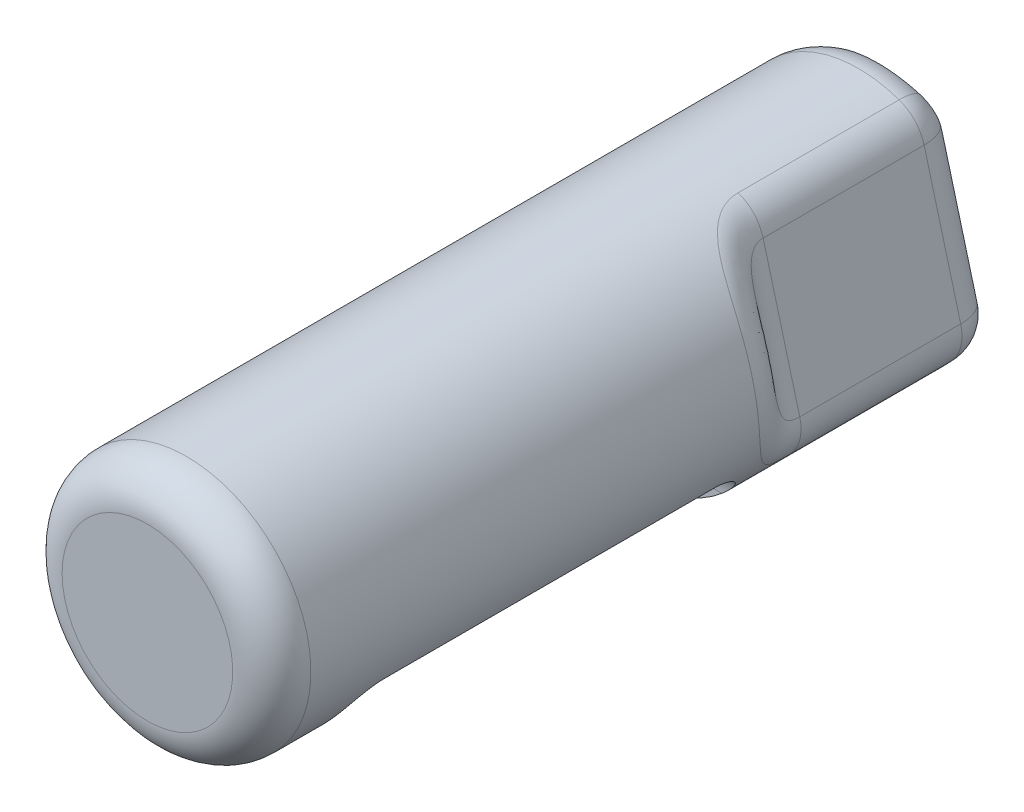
ISO-10303-21;
HEADER;
FILE_DESCRIPTION(('STEP AP214'),'2;1');
FILE_NAME('part.step','',(''),(''),'','','');
FILE_SCHEMA(('AUTOMOTIVE_DESIGN { 1 0 10303 214 1 1 1 1 }'));
ENDSEC;
DATA;
#1=APPLICATION_CONTEXT('core data for automotive mechanical design processes');
#2=APPLICATION_PROTOCOL_DEFINITION('international standard','automotive_design',2000,#1);
#3=PRODUCT_CONTEXT('',#1,'mechanical');
#4=PRODUCT('Part','Part','',(#3));
#5=PRODUCT_RELATED_PRODUCT_CATEGORY('part','',(#4));
#6=PRODUCT_DEFINITION_FORMATION('','',#4);
#7=PRODUCT_DEFINITION_CONTEXT('part definition',#1,'design');
#8=PRODUCT_DEFINITION('design','',#6,#7);
#9=PRODUCT_DEFINITION_SHAPE('','',#8);
#10=(LENGTH_UNIT() NAMED_UNIT(*) SI_UNIT(.MILLI.,.METRE.));
#11=(NAMED_UNIT(*) PLANE_ANGLE_UNIT() SI_UNIT($,.RADIAN.));
#12=(NAMED_UNIT(*) SI_UNIT($,.STERADIAN.) SOLID_ANGLE_UNIT());
#13=UNCERTAINTY_MEASURE_WITH_UNIT(LENGTH_MEASURE(1.E-05),#10,'distance_accuracy_value','');
#14=(GEOMETRIC_REPRESENTATION_CONTEXT(3) GLOBAL_UNCERTAINTY_ASSIGNED_CONTEXT((#13)) GLOBAL_UNIT_ASSIGNED_CONTEXT((#10,
#11,#12)) REPRESENTATION_CONTEXT('',''));
#15=CARTESIAN_POINT('',(0.,0.,0.));
#16=DIRECTION('',(0.,0.,1.));
#17=DIRECTION('',(1.,0.,0.));
#18=AXIS2_PLACEMENT_3D('',#15,#16,#17);
#19=CARTESIAN_POINT('',(0.,0.,0.));
#20=DIRECTION('',(0.,0.,-1.));
#21=DIRECTION('',(-1.,0.,0.));
#22=AXIS2_PLACEMENT_3D('',#19,#20,#21);
#23=PLANE('',#22);
#24=DIRECTION('',(1.,0.,0.));
#25=VECTOR('',#24,1.);
#26=CARTESIAN_POINT('',(-2.54,0.939799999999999,0.));
#27=LINE('',#26,#25);
#28=CARTESIAN_POINT('',(-1.45669885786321,0.939799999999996,0.));
#29=VERTEX_POINT('',#28);
#30=CARTESIAN_POINT('',(0.754003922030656,0.939799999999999,0.));
#31=VERTEX_POINT('',#30);
#32=EDGE_CURVE('E141',#29,#31,#27,.T.);
#33=ORIENTED_EDGE('',*,*,#32,.T.);
#34=DIRECTION('',(-0.258819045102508,0.965925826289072,0.));
#35=VECTOR('',#34,1.);
#36=CARTESIAN_POINT('',(1.40654015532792,-1.49549837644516,0.));
#37=LINE('',#36,#35);
#38=CARTESIAN_POINT('',(1.31003640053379,-1.13534146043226,0.));
#39=VERTEX_POINT('',#38);
#40=EDGE_CURVE('E286',#31,#39,#37,.F.);
#41=ORIENTED_EDGE('',*,*,#40,.T.);
#42=CARTESIAN_POINT('',(0.,0.,0.));
#43=DIRECTION('',(0.,0.,-1.));
#44=DIRECTION('',(-1.,0.,0.));
#45=AXIS2_PLACEMENT_3D('',#42,#43,#44);
#46=CIRCLE('',#45,1.73354999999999);
#47=EDGE_CURVE('E129',#39,#29,#46,.T.);
#48=ORIENTED_EDGE('',*,*,#47,.T.);
#49=EDGE_LOOP('',(#33,#41,#48));
#50=FACE_BOUND('',#49,.T.);
#51=ADVANCED_FACE('F35',(#50),#23,.T.);
#52=CARTESIAN_POINT('',(0.,0.,0.79375));
#53=DIRECTION('',(0.,0.,-1.));
#54=DIRECTION('',(-1.,0.,0.));
#55=AXIS2_PLACEMENT_3D('',#52,#53,#54);
#56=TOROIDAL_SURFACE('',#55,1.73355,0.79375);
#57=ORIENTED_EDGE('',*,*,#47,.F.);
#58=CARTESIAN_POINT('',(1.31003640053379,-1.13534146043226,0.79375));
#59=DIRECTION('',(-0.654922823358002,-0.755695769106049,0.));
#60=DIRECTION('',(0.755695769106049,-0.654922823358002,0.));
#61=AXIS2_PLACEMENT_3D('',#58,#59,#60);
#62=CIRCLE('',#61,0.79375);
#63=CARTESIAN_POINT('',(1.90986991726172,-1.65518645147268,0.793750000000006));
#64=VERTEX_POINT('',#63);
#65=EDGE_CURVE('E290',#39,#64,#62,.T.);
#66=ORIENTED_EDGE('',*,*,#65,.T.);
#67=CARTESIAN_POINT('',(0.,0.,0.793750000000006));
#68=DIRECTION('',(0.,0.,-1.));
#69=DIRECTION('',(-1.,0.,0.));
#70=AXIS2_PLACEMENT_3D('',#67,#68,#69);
#71=CIRCLE('',#70,2.5273);
#72=CARTESIAN_POINT('',(0.826402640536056,2.388368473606,0.793750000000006));
#73=VERTEX_POINT('',#72);
#74=EDGE_CURVE('E157',#64,#73,#71,.T.);
#75=ORIENTED_EDGE('',*,*,#74,.T.);
#76=CARTESIAN_POINT('',(0.566854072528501,1.63825274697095,0.79375));
#77=DIRECTION('',(0.945027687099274,-0.326990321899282,0.));
#78=DIRECTION('',(0.326990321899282,0.945027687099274,0.));
#79=AXIS2_PLACEMENT_3D('',#76,#77,#78);
#80=CIRCLE('',#79,0.79375);
#81=CARTESIAN_POINT('',(0.783054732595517,2.26308961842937,0.35457438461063));
#82=VERTEX_POINT('',#81);
#83=EDGE_CURVE('E288',#73,#82,#80,.F.);
#84=ORIENTED_EDGE('',*,*,#83,.T.);
#85=CARTESIAN_POINT('',(0.,1.33667499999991,0.106342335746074));
#86=CARTESIAN_POINT('',(-0.0546777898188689,1.33667644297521,0.106342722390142));
#87=CARTESIAN_POINT('',(-0.109348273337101,1.33437773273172,0.105726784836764));
#88=CARTESIAN_POINT('',(-0.218283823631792,1.32526441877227,0.10328487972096));
#89=CARTESIAN_POINT('',(-0.272548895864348,1.31844987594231,0.101458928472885));
#90=CARTESIAN_POINT('',(-0.380097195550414,1.30057221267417,0.0966686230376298));
#91=CARTESIAN_POINT('',(-0.433383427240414,1.2895257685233,0.0937087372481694));
#92=CARTESIAN_POINT('',(-0.538924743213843,1.26357390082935,0.0867549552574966));
#93=CARTESIAN_POINT('',(-0.591179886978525,1.24866870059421,0.082761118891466));
#94=CARTESIAN_POINT('',(-0.696391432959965,1.21496542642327,0.0737303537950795));
#95=CARTESIAN_POINT('',(-0.749306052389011,1.19604716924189,0.0686612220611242));
#96=CARTESIAN_POINT('',(-0.854045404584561,1.1555441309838,0.0578084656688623));
#97=CARTESIAN_POINT('',(-0.905869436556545,1.13395769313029,0.0520243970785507));
#98=CARTESIAN_POINT('',(-1.00909926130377,1.08931050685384,0.0400612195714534));
#99=CARTESIAN_POINT('',(-1.06050208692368,1.0662435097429,0.033880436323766));
#100=CARTESIAN_POINT('',(-1.13793807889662,1.03243405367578,0.0248212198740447));
#101=CARTESIAN_POINT('',(-1.16378809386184,1.02130320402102,0.0218387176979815));
#102=CARTESIAN_POINT('',(-1.21584612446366,0.999862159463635,0.0160936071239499));
#103=CARTESIAN_POINT('',(-1.24205391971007,0.989551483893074,0.0133308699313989));
#104=CARTESIAN_POINT('',(-1.29534702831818,0.970543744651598,0.00823776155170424));
#105=CARTESIAN_POINT('',(-1.32243786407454,0.961860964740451,0.00591121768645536));
#106=CARTESIAN_POINT('',(-1.37748761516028,0.947911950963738,0.00217359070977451));
#107=CARTESIAN_POINT('',(-1.40543788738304,0.942619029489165,0.000755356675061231));
#108=CARTESIAN_POINT('',(-1.4454512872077,0.939807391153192,1.98045352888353E-06));
#109=CARTESIAN_POINT('',(-1.45728052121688,0.939555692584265,-6.54619747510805E-05));
#110=CARTESIAN_POINT('',(-1.48089124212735,0.940568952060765,0.000206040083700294));
#111=CARTESIAN_POINT('',(-1.49267270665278,0.941834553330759,0.000545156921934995));
#112=CARTESIAN_POINT('',(-1.51603153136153,0.94625796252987,0.00173040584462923));
#113=CARTESIAN_POINT('',(-1.52760420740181,0.949440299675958,0.00258311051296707));
#114=CARTESIAN_POINT('',(-1.54987593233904,0.957931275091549,0.00485826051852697));
#115=CARTESIAN_POINT('',(-1.56057663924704,0.963235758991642,0.00627959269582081));
#116=CARTESIAN_POINT('',(-1.57942125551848,0.975099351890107,0.00945843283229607));
#117=CARTESIAN_POINT('',(-1.58771789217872,0.981433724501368,0.0111557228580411));
#118=CARTESIAN_POINT('',(-1.60305763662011,0.995391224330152,0.0148956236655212));
#119=CARTESIAN_POINT('',(-1.61009933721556,1.00301577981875,0.0169386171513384));
#120=CARTESIAN_POINT('',(-1.6245502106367,1.02133731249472,0.0218478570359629));
#121=CARTESIAN_POINT('',(-1.63157332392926,1.03231617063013,0.0247896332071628));
#122=CARTESIAN_POINT('',(-1.64371542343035,1.05521025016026,0.030924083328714));
#123=CARTESIAN_POINT('',(-1.6488306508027,1.06712726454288,0.0341172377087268));
#124=CARTESIAN_POINT('',(-1.65985579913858,1.09838747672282,0.0424933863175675));
#125=CARTESIAN_POINT('',(-1.66457740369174,1.11811691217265,0.0477798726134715));
#126=CARTESIAN_POINT('',(-1.67092645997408,1.1580202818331,0.0584719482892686));
#127=CARTESIAN_POINT('',(-1.67254634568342,1.17819518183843,0.0638777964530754));
#128=CARTESIAN_POINT('',(-1.67365690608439,1.2336037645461,0.078724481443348));
#129=CARTESIAN_POINT('',(-1.67066850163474,1.2688793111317,0.0881765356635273));
#130=CARTESIAN_POINT('',(-1.65940805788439,1.33859500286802,0.106856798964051));
#131=CARTESIAN_POINT('',(-1.65112455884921,1.37303316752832,0.116084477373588));
#132=CARTESIAN_POINT('',(-1.62362482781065,1.46298391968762,0.140186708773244));
#133=CARTESIAN_POINT('',(-1.60080134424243,1.51747195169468,0.154786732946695));
#134=CARTESIAN_POINT('',(-1.54683508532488,1.62239202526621,0.18289998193));
#135=CARTESIAN_POINT('',(-1.51567852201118,1.67281716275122,0.196411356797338));
#136=CARTESIAN_POINT('',(-1.432970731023,1.78849461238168,0.22740703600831));
#137=CARTESIAN_POINT('',(-1.37824207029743,1.85163590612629,0.244325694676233));
#138=CARTESIAN_POINT('',(-1.25901836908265,1.96852187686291,0.275645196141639));
#139=CARTESIAN_POINT('',(-1.19451692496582,2.02226034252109,0.290044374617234));
#140=CARTESIAN_POINT('',(-1.05667768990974,2.12086164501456,0.316464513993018));
#141=CARTESIAN_POINT('',(-0.983192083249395,2.16553091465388,0.328433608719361));
#142=CARTESIAN_POINT('',(-0.830436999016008,2.24431113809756,0.349542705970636));
#143=CARTESIAN_POINT('',(-0.751167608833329,2.27842225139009,0.358682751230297));
#144=CARTESIAN_POINT('',(-0.574503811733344,2.34083797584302,0.375406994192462));
#145=CARTESIAN_POINT('',(-0.476341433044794,2.36712626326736,0.382450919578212));
#146=CARTESIAN_POINT('',(-0.276959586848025,2.40467595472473,0.392512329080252));
#147=CARTESIAN_POINT('',(-0.17573825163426,2.41592798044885,0.395527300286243));
#148=CARTESIAN_POINT('',(0.0350501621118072,2.42357562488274,0.397576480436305));
#149=CARTESIAN_POINT('',(0.144665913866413,2.41877493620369,0.396290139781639));
#150=CARTESIAN_POINT('',(0.36160301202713,2.39166983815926,0.389027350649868));
#151=CARTESIAN_POINT('',(0.468923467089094,2.36935875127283,0.383049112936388));
#152=CARTESIAN_POINT('',(0.679150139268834,2.30713021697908,0.366375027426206));
#153=CARTESIAN_POINT('',(0.782001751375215,2.26703964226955,0.355632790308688));
#154=CARTESIAN_POINT('',(0.978583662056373,2.16961915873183,0.329529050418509));
#155=CARTESIAN_POINT('',(1.07232165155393,2.11230395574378,0.314171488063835));
#156=CARTESIAN_POINT('',(1.2245291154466,1.99775216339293,0.283477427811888));
#157=CARTESIAN_POINT('',(1.28593508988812,1.94413172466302,0.269109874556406));
#158=CARTESIAN_POINT('',(1.39913874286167,1.82810176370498,0.238019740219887));
#159=CARTESIAN_POINT('',(1.45094979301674,1.76570468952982,0.221300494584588));
#160=CARTESIAN_POINT('',(1.52686970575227,1.654813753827,0.191587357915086));
#161=CARTESIAN_POINT('',(1.55447531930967,1.6085383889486,0.179187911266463));
#162=CARTESIAN_POINT('',(1.60264552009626,1.51266833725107,0.153499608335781));
#163=CARTESIAN_POINT('',(1.62322288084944,1.46307987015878,0.140212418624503));
#164=CARTESIAN_POINT('',(1.64856161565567,1.38203901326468,0.118497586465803));
#165=CARTESIAN_POINT('',(1.65634954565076,1.35146375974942,0.110304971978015));
#166=CARTESIAN_POINT('',(1.66788733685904,1.28958088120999,0.0937235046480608));
#167=CARTESIAN_POINT('',(1.67164135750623,1.25827404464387,0.0853348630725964));
#168=CARTESIAN_POINT('',(1.67344037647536,1.20627890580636,0.071402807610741));
#169=CARTESIAN_POINT('',(1.67300486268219,1.1856419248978,0.0658731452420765));
#170=CARTESIAN_POINT('',(1.66924085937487,1.14459997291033,0.0548759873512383));
#171=CARTESIAN_POINT('',(1.66591720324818,1.12419467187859,0.0494084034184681));
#172=CARTESIAN_POINT('',(1.65732795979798,1.091185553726,0.0405636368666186));
#173=CARTESIAN_POINT('',(1.65313229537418,1.07832544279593,0.0371177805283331));
#174=CARTESIAN_POINT('',(1.64283193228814,1.05333009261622,0.0304202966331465));
#175=CARTESIAN_POINT('',(1.63673010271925,1.0411937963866,0.0271683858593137));
#176=CARTESIAN_POINT('',(1.623933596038,1.02072987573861,0.0216850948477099));
#177=CARTESIAN_POINT('',(1.61766903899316,1.01215379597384,0.0193871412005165));
#178=CARTESIAN_POINT('',(1.60376316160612,0.996115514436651,0.0150896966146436));
#179=CARTESIAN_POINT('',(1.59612368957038,0.988651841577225,0.0130898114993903));
#180=CARTESIAN_POINT('',(1.57950959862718,0.975144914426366,0.00947064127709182));
#181=CARTESIAN_POINT('',(1.5705270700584,0.969110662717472,0.0078537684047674));
#182=CARTESIAN_POINT('',(1.55155349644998,0.958765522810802,0.0050817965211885));
#183=CARTESIAN_POINT('',(1.5415619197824,0.954455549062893,0.00392694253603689));
#184=CARTESIAN_POINT('',(1.51971083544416,0.947155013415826,0.00197076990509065));
#185=CARTESIAN_POINT('',(1.50777210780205,0.944389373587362,0.00122971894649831));
#186=CARTESIAN_POINT('',(1.48359899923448,0.940766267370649,0.000258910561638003));
#187=CARTESIAN_POINT('',(1.47136423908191,0.939911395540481,2.98483451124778E-05));
#188=CARTESIAN_POINT('',(1.43835461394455,0.939637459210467,-4.35526732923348E-05));
#189=CARTESIAN_POINT('',(1.41757962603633,0.941637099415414,0.000492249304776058));
#190=CARTESIAN_POINT('',(1.37649068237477,0.948325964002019,0.00228452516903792));
#191=CARTESIAN_POINT('',(1.3561792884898,0.953027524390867,0.00354430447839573));
#192=CARTESIAN_POINT('',(1.31292751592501,0.964927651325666,0.00673293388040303));
#193=CARTESIAN_POINT('',(1.29007095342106,0.972401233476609,0.00873547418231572));
#194=CARTESIAN_POINT('',(1.24482540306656,0.988588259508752,0.0130727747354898));
#195=CARTESIAN_POINT('',(1.22243695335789,0.997303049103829,0.0154078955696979));
#196=CARTESIAN_POINT('',(1.15556590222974,1.0244626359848,0.0226852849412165));
#197=CARTESIAN_POINT('',(1.11151468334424,1.04387607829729,0.0278871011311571));
#198=CARTESIAN_POINT('',(1.02330117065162,1.0828605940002,0.03833297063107));
#199=CARTESIAN_POINT('',(0.979139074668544,1.10243198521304,0.0435771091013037));
#200=CARTESIAN_POINT('',(0.890342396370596,1.14039385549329,0.0537489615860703));
#201=CARTESIAN_POINT('',(0.845708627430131,1.1587860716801,0.0586771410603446));
#202=CARTESIAN_POINT('',(0.737027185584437,1.20076947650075,0.0699265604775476));
#203=CARTESIAN_POINT('',(0.672561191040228,1.22337844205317,0.0759846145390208));
#204=CARTESIAN_POINT('',(0.541787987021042,1.26312603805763,0.0866349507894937));
#205=CARTESIAN_POINT('',(0.475480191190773,1.28026290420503,0.0912267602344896));
#206=CARTESIAN_POINT('',(0.341374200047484,1.30807956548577,0.098680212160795));
#207=CARTESIAN_POINT('',(0.273575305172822,1.31875625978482,0.101541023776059));
#208=CARTESIAN_POINT('',(0.137180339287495,1.33305240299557,0.105371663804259));
#209=CARTESIAN_POINT('',(0.0685844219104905,1.33667319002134,0.10634185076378));
#210=CARTESIAN_POINT('',(0.,1.33667499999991,0.106342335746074));
#211=B_SPLINE_CURVE_WITH_KNOTS('',3,(#85,#86,#87,#88,#89,#90,#91,#92,#93,#94,#95,#96,#97,#98,
#99,#100,#101,#102,#103,#104,#105,#106,#107,#108,#109,#110,#111,#112,#113,#114,#115,#116,#117,
#118,#119,#120,#121,#122,#123,#124,#125,#126,#127,#128,#129,#130,#131,#132,#133,#134,#135,#136,
#137,#138,#139,#140,#141,#142,#143,#144,#145,#146,#147,#148,#149,#150,#151,#152,#153,#154,#155,
#156,#157,#158,#159,#160,#161,#162,#163,#164,#165,#166,#167,#168,#169,#170,#171,#172,#173,#174,
#175,#176,#177,#178,#179,#180,#181,#182,#183,#184,#185,#186,#187,#188,#189,#190,#191,#192,#193,
#194,#195,#196,#197,#198,#199,#200,#201,#202,#203,#204,#205,#206,#207,#208,#209,#210),
.UNSPECIFIED.,.T.,.F.,(4,2,2,2,2,2,2,2,2,2,2,2,2,2,2,2,2,2,2,2,2,2,2,2,2,2,2,2,2,2,2,2,2,2,2,2,
2,2,2,2,2,2,2,2,2,2,2,2,2,2,2,2,2,2,2,2,2,2,2,2,2,2,4),(0.,0.163970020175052,0.327937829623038,
0.491266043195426,0.654584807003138,0.823745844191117,0.993012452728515,1.16304756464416,
1.24795243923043,1.33280718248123,1.41837479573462,1.5032601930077,1.53867718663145,
1.57410919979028,1.61000458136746,1.64583003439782,1.67738771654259,1.70898056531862,
1.74884090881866,1.78877937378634,1.85131836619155,1.9140097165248,2.02331969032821,
2.13286703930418,2.31441078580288,2.49625679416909,2.75065455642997,3.00521973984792,
3.26475029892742,3.52427693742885,3.82856724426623,4.13304725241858,4.46070869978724,
4.78849516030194,5.11954601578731,5.45031502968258,5.69777370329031,5.94488487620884,
6.11034514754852,6.2755030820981,6.37311448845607,6.47062514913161,6.53459775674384,
6.59846351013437,6.64022990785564,6.68193374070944,6.71440732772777,6.74683758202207,
6.77946695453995,6.81211360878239,6.84874045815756,6.88541701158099,6.94769399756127,
7.01025760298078,7.08257504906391,7.15497150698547,7.30019937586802,7.44596844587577,
7.59151759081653,7.79706559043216,8.00267979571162,8.20839261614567,8.41406642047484),.UNSPECIFIED.);
#212=EDGE_CURVE('E137',#29,#82,#211,.T.);
#213=ORIENTED_EDGE('',*,*,#212,.F.);
#214=EDGE_LOOP('',(#57,#66,#75,#84,#213));
#215=FACE_BOUND('',#214,.T.);
#216=ADVANCED_FACE('F193',(#215),#56,.T.);
#217=CARTESIAN_POINT('',(0.,0.,0.));
#218=DIRECTION('',(0.,0.,-1.));
#219=DIRECTION('',(-1.,0.,0.));
#220=AXIS2_PLACEMENT_3D('',#217,#218,#219);
#221=CYLINDRICAL_SURFACE('',#220,2.5273);
#222=ORIENTED_EDGE('',*,*,#74,.F.);
#223=DIRECTION('',(0.,0.,-1.));
#224=VECTOR('',#223,1.);
#225=CARTESIAN_POINT('',(1.90986991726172,-1.65518645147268,0.));
#226=LINE('',#225,#224);
#227=CARTESIAN_POINT('',(1.90986991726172,-1.65518645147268,4.064));
#228=VERTEX_POINT('',#227);
#229=EDGE_CURVE('E48',#64,#228,#226,.F.);
#230=ORIENTED_EDGE('',*,*,#229,.T.);
#231=CARTESIAN_POINT('',(2.13333061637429,-0.739501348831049,3.67980759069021));
#232=CARTESIAN_POINT('',(2.3114591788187,-1.06940831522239,3.53135150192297));
#233=CARTESIAN_POINT('',(2.14484197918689,-1.33674910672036,3.27960716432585));
#234=CARTESIAN_POINT('',(2.12961391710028,-0.756049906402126,3.6932879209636));
#235=CARTESIAN_POINT('',(2.30194838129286,-1.09222163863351,3.55019892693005));
#236=CARTESIAN_POINT('',(2.12787458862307,-1.36396936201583,3.30712950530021));
#237=CARTESIAN_POINT('',(2.1258887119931,-0.771432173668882,3.70722809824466));
#238=CARTESIAN_POINT('',(2.29276761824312,-1.11350493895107,3.56970218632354));
#239=CARTESIAN_POINT('',(2.11132553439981,-1.38937389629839,3.33559070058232));
#240=CARTESIAN_POINT('',(2.11857784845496,-0.799921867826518,3.7359272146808));
#241=CARTESIAN_POINT('',(2.27525987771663,-1.15306501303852,3.60983968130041));
#242=CARTESIAN_POINT('',(2.07949224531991,-1.43658213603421,3.39418472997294));
#243=CARTESIAN_POINT('',(2.11499213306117,-0.813030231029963,3.75068581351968));
#244=CARTESIAN_POINT('',(2.26693137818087,-1.17134473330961,3.63047881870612));
#245=CARTESIAN_POINT('',(2.06420749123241,-1.45838732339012,3.42431686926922));
#246=CARTESIAN_POINT('',(2.10469685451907,-0.848970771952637,3.79595548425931));
#247=CARTESIAN_POINT('',(2.24355752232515,-1.22166447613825,3.69372554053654));
#248=CARTESIAN_POINT('',(2.02096595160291,-1.5183489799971,3.51674244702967));
#249=CARTESIAN_POINT('',(2.09842260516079,-0.868526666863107,3.82755062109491));
#250=CARTESIAN_POINT('',(2.2300841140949,-1.24927533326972,3.73774384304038));
#251=CARTESIAN_POINT('',(1.99550444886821,-1.5512304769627,3.58124918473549));
#252=CARTESIAN_POINT('',(2.08797161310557,-0.899559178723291,3.89280023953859));
#253=CARTESIAN_POINT('',(2.20818950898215,-1.29332991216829,3.8282703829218));
#254=CARTESIAN_POINT('',(1.95367862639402,-1.60359667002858,3.71446715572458));
#255=CARTESIAN_POINT('',(2.08380757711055,-0.91098701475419,3.92646585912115));
#256=CARTESIAN_POINT('',(2.19981487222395,-1.30967188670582,3.87477432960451));
#257=CARTESIAN_POINT('',(1.93736935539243,-1.62300046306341,3.78320112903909));
#258=CARTESIAN_POINT('',(2.07819128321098,-0.926160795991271,3.99475431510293));
#259=CARTESIAN_POINT('',(2.18859991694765,-1.33143600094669,3.96887621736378));
#260=CARTESIAN_POINT('',(1.91546301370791,-1.64879780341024,3.92262339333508));
#261=CARTESIAN_POINT('',(2.07674016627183,-0.929903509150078,4.02937754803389));
#262=CARTESIAN_POINT('',(2.18577529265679,-1.33682738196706,4.01642231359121));
#263=CARTESIAN_POINT('',(1.90987045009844,-1.65518587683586,3.99331249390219));
#264=CARTESIAN_POINT('',(2.07673988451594,-0.929904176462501,4.09850314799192));
#265=CARTESIAN_POINT('',(2.18577469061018,-1.33682836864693,4.11141374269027));
#266=CARTESIAN_POINT('',(1.90986938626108,-1.65518702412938,4.13444392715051));
#267=CARTESIAN_POINT('',(2.07818073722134,-0.926187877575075,4.1330055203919));
#268=CARTESIAN_POINT('',(2.18857928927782,-1.33147504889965,4.15879391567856));
#269=CARTESIAN_POINT('',(1.91542241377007,-1.64884404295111,4.20488627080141));
#270=CARTESIAN_POINT('',(2.08376119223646,-0.911113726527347,4.20108092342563));
#271=CARTESIAN_POINT('',(2.19972193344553,-1.30985325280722,4.25260065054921));
#272=CARTESIAN_POINT('',(1.93718790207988,-1.62321569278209,4.34387355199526));
#273=CARTESIAN_POINT('',(2.08790079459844,-0.899755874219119,4.23465395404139));
#274=CARTESIAN_POINT('',(2.20804677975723,-1.29361061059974,4.29897538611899));
#275=CARTESIAN_POINT('',(1.95340036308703,-1.60393032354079,4.41241848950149));
#276=CARTESIAN_POINT('',(2.09833049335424,-0.868813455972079,4.29997602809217));
#277=CARTESIAN_POINT('',(2.22988577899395,-1.24968085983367,4.3895964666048));
#278=CARTESIAN_POINT('',(1.99513076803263,-1.55171272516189,4.54578439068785));
#279=CARTESIAN_POINT('',(2.1046246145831,-0.849213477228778,4.33172152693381));
#280=CARTESIAN_POINT('',(2.24339382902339,-1.22200620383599,4.43382163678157));
#281=CARTESIAN_POINT('',(2.02066613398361,-1.51875493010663,4.61059811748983));
#282=CARTESIAN_POINT('',(2.1184063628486,-0.801120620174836,4.39233236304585));
#283=CARTESIAN_POINT('',(2.27466636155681,-1.15470325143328,4.5184608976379));
#284=CARTESIAN_POINT('',(2.078544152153,-1.43851682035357,4.73434524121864));
#285=CARTESIAN_POINT('',(2.12589335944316,-0.772632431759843,4.42119920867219));
#286=CARTESIAN_POINT('',(2.29242648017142,-1.11509158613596,4.5589029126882));
#287=CARTESIAN_POINT('',(2.11088321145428,-1.39124405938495,4.79328171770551));
#288=CARTESIAN_POINT('',(2.14056205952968,-0.707287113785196,4.4744386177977));
#289=CARTESIAN_POINT('',(2.32994333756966,-1.02504167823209,4.63330622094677));
#290=CARTESIAN_POINT('',(2.17786099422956,-1.28376221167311,4.9019788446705));
#291=CARTESIAN_POINT('',(2.14774647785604,-0.670683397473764,4.49891344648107));
#292=CARTESIAN_POINT('',(2.34965094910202,-0.974892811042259,4.66746674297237));
#293=CARTESIAN_POINT('',(2.21241131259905,-1.22394731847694,4.95194828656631));
#294=CARTESIAN_POINT('',(2.16068086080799,-0.588951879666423,4.54375800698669));
#295=CARTESIAN_POINT('',(2.38914112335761,-0.863750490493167,4.72949227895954));
#296=CARTESIAN_POINT('',(2.28062444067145,-1.09156793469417,5.04350593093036));
#297=CARTESIAN_POINT('',(2.16643109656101,-0.543825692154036,4.56412851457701));
#298=CARTESIAN_POINT('',(2.40895747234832,-0.802660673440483,4.75740959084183));
#299=CARTESIAN_POINT('',(2.31428741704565,-1.01900585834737,5.08509571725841));
#300=CARTESIAN_POINT('',(2.17512667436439,-0.447620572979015,4.60001147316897));
#301=CARTESIAN_POINT('',(2.44542225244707,-0.673143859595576,4.80577387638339));
#302=CARTESIAN_POINT('',(2.37580994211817,-0.865662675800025,5.1583567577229));
#303=CARTESIAN_POINT('',(2.17815618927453,-0.396779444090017,4.61565896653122));
#304=CARTESIAN_POINT('',(2.46217668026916,-0.604894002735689,4.82645878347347));
#305=CARTESIAN_POINT('',(2.40382118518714,-0.785220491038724,5.19030372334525));
#306=CARTESIAN_POINT('',(2.18089779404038,-0.289413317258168,4.64316031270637));
#307=CARTESIAN_POINT('',(2.49103101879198,-0.461255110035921,4.861991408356));
#308=CARTESIAN_POINT('',(2.45246475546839,-0.616731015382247,5.24645230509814));
#309=CARTESIAN_POINT('',(2.18060865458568,-0.232886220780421,4.65501275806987));
#310=CARTESIAN_POINT('',(2.50312909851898,-0.385765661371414,4.87683649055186));
#311=CARTESIAN_POINT('',(2.47309434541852,-0.528680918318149,5.27065104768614));
#312=CARTESIAN_POINT('',(2.1760904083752,-0.112205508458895,4.67594285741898));
#313=CARTESIAN_POINT('',(2.521374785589,-0.224913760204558,4.90233751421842));
#314=CARTESIAN_POINT('',(2.50592248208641,-0.342182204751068,5.31338333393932));
#315=CARTESIAN_POINT('',(2.17162688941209,-0.0477980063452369,4.68481236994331));
#316=CARTESIAN_POINT('',(2.52709467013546,-0.139203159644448,4.9126683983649));
#317=CARTESIAN_POINT('',(2.51754353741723,-0.243426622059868,5.33149192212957));
#318=CARTESIAN_POINT('',(2.15819682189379,0.0838732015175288,4.69931302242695));
#319=CARTESIAN_POINT('',(2.52975911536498,0.0357288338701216,4.92907046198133));
#320=CARTESIAN_POINT('',(2.52892485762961,-0.0431705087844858,5.36109742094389));
#321=CARTESIAN_POINT('',(2.14922818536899,0.151138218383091,4.70494265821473));
#322=CARTESIAN_POINT('',(2.52666364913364,0.124906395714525,4.93511707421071));
#323=CARTESIAN_POINT('',(2.52867961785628,0.0583312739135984,5.37259126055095));
#324=CARTESIAN_POINT('',(2.12556134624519,0.294490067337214,4.71389471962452));
#325=CARTESIAN_POINT('',(2.50996743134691,0.314545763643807,4.94454246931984));
#326=CARTESIAN_POINT('',(2.51506721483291,0.272918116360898,5.3908683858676));
#327=CARTESIAN_POINT('',(2.11033587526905,0.370724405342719,4.71688997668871));
#328=CARTESIAN_POINT('',(2.49521598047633,0.414954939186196,4.94752647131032));
#329=CARTESIAN_POINT('',(2.50024027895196,0.386033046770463,5.39698370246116));
#330=CARTESIAN_POINT('',(2.07463808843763,0.522751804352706,4.71979297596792));
#331=CARTESIAN_POINT('',(2.45360507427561,0.614276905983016,4.95042764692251));
#332=CARTESIAN_POINT('',(2.45533541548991,0.609582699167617,5.40291065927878));
#333=CARTESIAN_POINT('',(2.05416313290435,0.598544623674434,4.71969916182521));
#334=CARTESIAN_POINT('',(2.42677631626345,0.712944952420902,4.95033625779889));
#335=CARTESIAN_POINT('',(2.42524980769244,0.720016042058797,5.40271912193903));
#336=CARTESIAN_POINT('',(2.00698864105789,0.752648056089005,4.71630448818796));
#337=CARTESIAN_POINT('',(2.35964425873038,0.912095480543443,4.94693890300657));
#338=CARTESIAN_POINT('',(2.34814026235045,0.942446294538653,5.39578833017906));
#339=CARTESIAN_POINT('',(1.97997200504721,0.830804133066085,4.71279645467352));
#340=CARTESIAN_POINT('',(2.31868743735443,1.01202597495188,4.94343455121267));
#341=CARTESIAN_POINT('',(2.30014606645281,1.05408180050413,5.38862609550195));
#342=CARTESIAN_POINT('',(1.92148519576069,0.982211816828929,4.70180782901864));
#343=CARTESIAN_POINT('',(2.22599043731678,1.20363109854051,4.93175883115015));
#344=CARTESIAN_POINT('',(2.1894927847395,1.26801297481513,5.36619098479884));
#345=CARTESIAN_POINT('',(1.89001496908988,1.05546336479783,4.69432718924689));
#346=CARTESIAN_POINT('',(2.17437940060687,1.29515078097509,4.92361586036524));
#347=CARTESIAN_POINT('',(2.12683352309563,1.37030853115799,5.35091801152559));
#348=CARTESIAN_POINT('',(1.82474462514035,1.1931748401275,4.67478698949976));
#349=CARTESIAN_POINT('',(2.06500484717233,1.46528278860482,4.90095359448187));
#350=CARTESIAN_POINT('',(1.99147932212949,1.56030364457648,5.3110234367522));
#351=CARTESIAN_POINT('',(1.79101054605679,1.2577920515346,4.66283119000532));
#352=CARTESIAN_POINT('',(2.00746744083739,1.54413333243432,4.88661504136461));
#353=CARTESIAN_POINT('',(1.91903394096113,1.64827357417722,5.28661367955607));
#354=CARTESIAN_POINT('',(1.72256831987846,1.37780451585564,4.6334651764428));
#355=CARTESIAN_POINT('',(1.88982893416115,1.68919227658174,4.84966753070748));
#356=CARTESIAN_POINT('',(1.76784179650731,1.8094610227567,5.2266580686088));
#357=CARTESIAN_POINT('',(1.68786147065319,1.43321143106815,4.6160619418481));
#358=CARTESIAN_POINT('',(1.82968250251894,1.75554703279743,4.82708706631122));
#359=CARTESIAN_POINT('',(1.68910319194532,1.88269722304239,5.19112646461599));
#360=CARTESIAN_POINT('',(1.6235290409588,1.52787846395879,4.57741237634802));
#361=CARTESIAN_POINT('',(1.7182570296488,1.86834947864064,4.77546971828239));
#362=CARTESIAN_POINT('',(1.54010323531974,2.0059161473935,5.11221693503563));
#363=CARTESIAN_POINT('',(1.59375317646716,1.56822436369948,4.5567634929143));
#364=CARTESIAN_POINT('',(1.66662196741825,1.91627158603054,4.74734461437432));
#365=CARTESIAN_POINT('',(1.46982207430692,2.05753520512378,5.07005879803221));
#366=CARTESIAN_POINT('',(1.53730806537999,1.63974572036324,4.51076405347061));
#367=CARTESIAN_POINT('',(1.56918132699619,2.00128251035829,4.68394790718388));
#368=CARTESIAN_POINT('',(1.33470895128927,2.14765050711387,4.97614327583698));
#369=CARTESIAN_POINT('',(1.51063736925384,1.6709254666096,4.4854157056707));
#370=CARTESIAN_POINT('',(1.52327323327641,2.03846726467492,4.6486219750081));
#371=CARTESIAN_POINT('',(1.26987445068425,2.1861528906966,4.92439039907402));
#372=CARTESIAN_POINT('',(1.46407705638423,1.72226142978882,4.4329694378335));
#373=CARTESIAN_POINT('',(1.4436296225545,2.10007236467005,4.57537518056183));
#374=CARTESIAN_POINT('',(1.15551433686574,2.24853979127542,4.81731260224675));
#375=CARTESIAN_POINT('',(1.44380367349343,1.74312955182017,4.40620356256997));
#376=CARTESIAN_POINT('',(1.409145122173,2.12534191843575,4.53787674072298));
#377=CARTESIAN_POINT('',(1.10515576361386,2.27338889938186,4.76266560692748));
#378=CARTESIAN_POINT('',(1.40801041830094,1.77837611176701,4.34994489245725));
#379=CARTESIAN_POINT('',(1.34859730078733,2.168414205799,4.45925647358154));
#380=CARTESIAN_POINT('',(1.01564001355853,2.31477047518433,4.64780415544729));
#381=CARTESIAN_POINT('',(1.39249434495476,1.79274936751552,4.3204499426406));
#382=CARTESIAN_POINT('',(1.32254046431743,2.1862083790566,4.41810413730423));
#383=CARTESIAN_POINT('',(0.976491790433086,2.33129630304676,4.58758529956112));
#384=CARTESIAN_POINT('',(1.36644880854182,1.81612778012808,4.2589352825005));
#385=CARTESIAN_POINT('',(1.27897892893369,2.21543017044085,4.33261516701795));
#386=CARTESIAN_POINT('',(0.910492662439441,2.35786904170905,4.46199286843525));
#387=CARTESIAN_POINT('',(1.35603048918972,1.82501431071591,4.22687565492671));
#388=CARTESIAN_POINT('',(1.26169038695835,2.22669813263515,4.28823800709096));
#389=CARTESIAN_POINT('',(0.883916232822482,2.36777313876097,4.39653779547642));
#390=CARTESIAN_POINT('',(1.34092663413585,1.83770502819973,4.16170017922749));
#391=CARTESIAN_POINT('',(1.23666092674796,2.24289097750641,4.19828812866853));
#392=CARTESIAN_POINT('',(0.845314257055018,2.38183137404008,4.26347119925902));
#393=CARTESIAN_POINT('',(1.3362284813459,1.84152040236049,4.12858682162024));
#394=CARTESIAN_POINT('',(1.22892450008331,2.24781307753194,4.15275786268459));
#395=CARTESIAN_POINT('',(0.833256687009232,2.38599816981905,4.1958647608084));
#396=CARTESIAN_POINT('',(1.33384244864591,1.84345781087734,4.08493328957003));
#397=CARTESIAN_POINT('',(1.2249927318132,2.2503145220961,4.09276373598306));
#398=CARTESIAN_POINT('',(0.827132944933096,2.38811389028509,4.10673879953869));
#399=CARTESIAN_POINT('',(1.33355699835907,1.84368953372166,4.07446906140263));
#400=CARTESIAN_POINT('',(1.22452228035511,2.25061382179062,4.07838580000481));
#401=CARTESIAN_POINT('',(0.826400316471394,2.38836691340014,4.08537433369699));
#402=CARTESIAN_POINT('',(1.33355999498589,1.8436930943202,4.02957426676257));
#403=CARTESIAN_POINT('',(1.22452421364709,2.25061628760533,4.01669485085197));
#404=CARTESIAN_POINT('',(0.826410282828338,2.38837360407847,3.99371412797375));
#405=CARTESIAN_POINT('',(1.33665645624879,1.84119915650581,3.99509627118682));
#406=CARTESIAN_POINT('',(1.22961603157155,2.24738903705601,3.96934634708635));
#407=CARTESIAN_POINT('',(0.834365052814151,2.38565963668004,3.92332155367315));
#408=CARTESIAN_POINT('',(1.34900617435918,1.83094988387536,3.92700449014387));
#409=CARTESIAN_POINT('',(1.25004396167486,2.23425511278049,3.87551693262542));
#410=CARTESIAN_POINT('',(0.865976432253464,2.37436346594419,3.78430083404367));
#411=CARTESIAN_POINT('',(1.35827630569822,1.8231801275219,3.89339333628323));
#412=CARTESIAN_POINT('',(1.2653837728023,2.2243459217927,3.82909071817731));
#413=CARTESIAN_POINT('',(0.889676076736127,2.36576517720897,3.71567806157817));
#414=CARTESIAN_POINT('',(1.38280333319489,1.80157763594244,3.82802556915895));
#415=CARTESIAN_POINT('',(1.30630216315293,2.19719572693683,3.73840538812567));
#416=CARTESIAN_POINT('',(0.951984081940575,2.34138566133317,3.58221887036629));
#417=CARTESIAN_POINT('',(1.3980625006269,1.78774260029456,3.79626966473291));
#418=CARTESIAN_POINT('',(1.33185386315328,2.17997345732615,3.69416430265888));
#419=CARTESIAN_POINT('',(0.990598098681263,2.32560170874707,3.51738389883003));
#420=CARTESIAN_POINT('',(1.42503398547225,1.7616873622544,3.75082232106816));
#421=CARTESIAN_POINT('',(1.37739921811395,2.14798564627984,3.63066969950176));
#422=CARTESIAN_POINT('',(1.05824284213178,2.29520572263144,3.42459557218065));
#423=CARTESIAN_POINT('',(1.4347079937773,1.75211531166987,3.7360340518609));
#424=CARTESIAN_POINT('',(1.39377602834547,2.13630327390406,3.6099891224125));
#425=CARTESIAN_POINT('',(1.08241928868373,2.2839499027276,3.3944028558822));
#426=CARTESIAN_POINT('',(1.45531766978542,1.73106608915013,3.70727914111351));
#427=CARTESIAN_POINT('',(1.42877457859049,2.11075796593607,3.56977362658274));
#428=CARTESIAN_POINT('',(1.13367587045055,2.25894602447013,3.33569491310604));
#429=CARTESIAN_POINT('',(1.46625379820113,1.71958822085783,3.6933128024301));
#430=CARTESIAN_POINT('',(1.44739901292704,2.09689333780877,3.55023372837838));
#431=CARTESIAN_POINT('',(1.16075706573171,2.24519705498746,3.30718030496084));
#432=CARTESIAN_POINT('',(1.47776783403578,1.70709226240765,3.67980759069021));
#433=CARTESIAN_POINT('',(1.46707821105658,2.08186435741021,3.53135150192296));
#434=CARTESIAN_POINT('',(1.18911308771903,2.23007967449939,3.27960716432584));
#435=(BOUNDED_SURFACE() B_SPLINE_SURFACE(3,2,((#231,#232,#233),(#234,#235,#236),(#237,#238,
#239),(#240,#241,#242),(#243,#244,#245),(#246,#247,#248),(#249,#250,#251),(#252,#253,#254),
(#255,#256,#257),(#258,#259,#260),(#261,#262,#263),(#264,#265,#266),(#267,#268,#269),(#270,#271,
#272),(#273,#274,#275),(#276,#277,#278),(#279,#280,#281),(#282,#283,#284),(#285,#286,#287),
(#288,#289,#290),(#291,#292,#293),(#294,#295,#296),(#297,#298,#299),(#300,#301,#302),(#303,#304,
#305),(#306,#307,#308),(#309,#310,#311),(#312,#313,#314),(#315,#316,#317),(#318,#319,#320),
(#321,#322,#323),(#324,#325,#326),(#327,#328,#329),(#330,#331,#332),(#333,#334,#335),(#336,#337,
#338),(#339,#340,#341),(#342,#343,#344),(#345,#346,#347),(#348,#349,#350),(#351,#352,#353),
(#354,#355,#356),(#357,#358,#359),(#360,#361,#362),(#363,#364,#365),(#366,#367,#368),(#369,#370,
#371),(#372,#373,#374),(#375,#376,#377),(#378,#379,#380),(#381,#382,#383),(#384,#385,#386),
(#387,#388,#389),(#390,#391,#392),(#393,#394,#395),(#396,#397,#398),(#399,#400,#401),(#402,#403,
#404),(#405,#406,#407),(#408,#409,#410),(#411,#412,#413),(#414,#415,#416),(#417,#418,#419),
(#420,#421,#422),(#423,#424,#425),(#426,#427,#428),(#429,#430,#431),(#432,#433,#434)),
.UNSPECIFIED.,.F.,.F.,.F.) B_SPLINE_SURFACE_WITH_KNOTS((4,2,2,2,2,2,2,2,2,2,2,2,2,2,2,2,2,2,2,2,
2,2,2,2,2,2,2,2,2,2,2,2,2,4),(3,3),(0.,0.105631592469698,0.211219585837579,0.421698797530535,
0.633430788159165,0.845251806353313,1.05634291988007,1.2674340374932,1.47892166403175,
1.69029788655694,1.8958246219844,2.10131247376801,2.30019902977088,2.49915926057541,
2.71000896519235,2.92095648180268,3.1554202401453,3.39000212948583,3.63976667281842,
3.88953421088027,4.13383721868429,4.37782848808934,4.59613395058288,4.81433709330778,
5.01398615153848,5.21379422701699,5.41778346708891,5.62132194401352,5.68542797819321,
5.8962298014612,6.10761018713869,6.31907081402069,6.42485635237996,6.53068062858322),(0.,1.),
.UNSPECIFIED.) GEOMETRIC_REPRESENTATION_ITEM() RATIONAL_B_SPLINE_SURFACE(((1.,0.89154633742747,
1.),(1.,0.891280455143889,1.),(1.,0.890941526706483,1.),(1.,0.890166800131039,1.),(1.,
0.889731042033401,1.),(1.,0.888354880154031,1.),(1.,0.887343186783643,1.),(1.,0.885523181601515,
1.),(1.,0.884716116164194,1.),(1.,0.883604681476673,1.),(1.,0.883300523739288,1.),(1.,
0.883300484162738,1.),(1.,0.883602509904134,1.),(1.,0.884707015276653,1.),(1.,0.885509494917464,
1.),(1.,0.887328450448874,1.),(1.,0.888345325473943,1.),(1.,0.890187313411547,1.),(1.,
0.891012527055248,1.),(1.,0.89206537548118,1.),(1.,0.892308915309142,1.),(1.,0.892033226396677,
1.),(1.,0.89151414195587,1.),(1.,0.889769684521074,1.),(1.,0.888567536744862,1.),(1.,
0.885702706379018,1.),(1.,0.884039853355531,1.),(1.,0.880494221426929,1.),(1.,0.878604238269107,
1.),(1.,0.875118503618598,1.),(1.,0.873522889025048,1.),(1.,0.870830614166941,1.),(1.,
0.869809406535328,1.),(1.,0.868821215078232,1.),(1.,0.86885476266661,1.),(1.,0.870006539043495,
1.),(1.,0.871194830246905,1.),(1.,0.874418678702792,1.),(1.,0.876454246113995,1.),(1.,
0.880707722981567,1.),(1.,0.882920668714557,1.),(1.,0.886883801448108,1.),(1.,0.888634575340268,
1.),(1.,0.891022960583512,1.),(1.,0.891758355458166,1.),(1.,0.892349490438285,1.),(1.,
0.892205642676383,1.),(1.,0.891294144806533,1.),(1.,0.890580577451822,1.),(1.,0.888916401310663,
1.),(1.,0.887965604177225,1.),(1.,0.886155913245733,1.),(1.,0.885299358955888,1.),(1.,
0.883998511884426,1.),(1.,0.883553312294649,1.),(1.,0.8833270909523,1.),(1.,0.883300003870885,
1.),(1.,0.883302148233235,1.),(1.,0.883602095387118,1.),(1.,0.884704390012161,1.),(1.,
0.885508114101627,1.),(1.,0.887328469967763,1.),(1.,0.888345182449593,1.),(1.,0.889726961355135,
1.),(1.,0.890163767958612,1.),(1.,0.890940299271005,1.),(1.,0.891279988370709,1.),(1.,
0.89154633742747,1.))) REPRESENTATION_ITEM('') SURFACE());
#436=CARTESIAN_POINT('',(2.14484197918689,-1.33674910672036,3.27960716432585));
#437=CARTESIAN_POINT('',(2.12787458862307,-1.36396936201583,3.30712950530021));
#438=CARTESIAN_POINT('',(2.11132553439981,-1.38937389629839,3.33559070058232));
#439=CARTESIAN_POINT('',(2.07949224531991,-1.43658213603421,3.39418472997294));
#440=CARTESIAN_POINT('',(2.06420749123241,-1.45838732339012,3.42431686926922));
#441=CARTESIAN_POINT('',(2.02096595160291,-1.5183489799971,3.51674244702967));
#442=CARTESIAN_POINT('',(1.99550444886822,-1.5512304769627,3.58124918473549));
#443=CARTESIAN_POINT('',(1.95367862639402,-1.60359667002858,3.71446715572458));
#444=CARTESIAN_POINT('',(1.93736935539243,-1.62300046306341,3.78320112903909));
#445=CARTESIAN_POINT('',(1.91546301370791,-1.64879780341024,3.92262339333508));
#446=CARTESIAN_POINT('',(1.90987045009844,-1.65518587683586,3.99331249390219));
#447=CARTESIAN_POINT('',(1.90986938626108,-1.65518702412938,4.13444392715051));
#448=CARTESIAN_POINT('',(1.91542241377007,-1.64884404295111,4.20488627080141));
#449=CARTESIAN_POINT('',(1.93718790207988,-1.62321569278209,4.34387355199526));
#450=CARTESIAN_POINT('',(1.95340036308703,-1.60393032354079,4.41241848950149));
#451=CARTESIAN_POINT('',(1.99513076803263,-1.55171272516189,4.54578439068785));
#452=CARTESIAN_POINT('',(2.02066613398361,-1.51875493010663,4.61059811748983));
#453=CARTESIAN_POINT('',(2.078544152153,-1.43851682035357,4.73434524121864));
#454=CARTESIAN_POINT('',(2.11088321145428,-1.39124405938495,4.79328171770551));
#455=CARTESIAN_POINT('',(2.17786099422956,-1.28376221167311,4.9019788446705));
#456=CARTESIAN_POINT('',(2.21241131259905,-1.22394731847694,4.95194828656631));
#457=CARTESIAN_POINT('',(2.28062444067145,-1.09156793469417,5.04350593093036));
#458=CARTESIAN_POINT('',(2.31428741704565,-1.01900585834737,5.08509571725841));
#459=CARTESIAN_POINT('',(2.37580994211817,-0.865662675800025,5.1583567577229));
#460=CARTESIAN_POINT('',(2.40382118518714,-0.785220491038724,5.19030372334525));
#461=CARTESIAN_POINT('',(2.45246475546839,-0.616731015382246,5.24645230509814));
#462=CARTESIAN_POINT('',(2.47309434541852,-0.528680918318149,5.27065104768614));
#463=CARTESIAN_POINT('',(2.50592248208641,-0.342182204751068,5.31338333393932));
#464=CARTESIAN_POINT('',(2.51754353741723,-0.243426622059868,5.33149192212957));
#465=CARTESIAN_POINT('',(2.52892485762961,-0.0431705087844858,5.36109742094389));
#466=CARTESIAN_POINT('',(2.52867961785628,0.0583312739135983,5.37259126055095));
#467=CARTESIAN_POINT('',(2.51506721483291,0.272918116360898,5.3908683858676));
#468=CARTESIAN_POINT('',(2.50024027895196,0.386033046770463,5.39698370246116));
#469=CARTESIAN_POINT('',(2.45533541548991,0.609582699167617,5.40291065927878));
#470=CARTESIAN_POINT('',(2.42524980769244,0.720016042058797,5.40271912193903));
#471=CARTESIAN_POINT('',(2.34814026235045,0.942446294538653,5.39578833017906));
#472=CARTESIAN_POINT('',(2.30014606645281,1.05408180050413,5.38862609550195));
#473=CARTESIAN_POINT('',(2.1894927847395,1.26801297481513,5.36619098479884));
#474=CARTESIAN_POINT('',(2.12683352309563,1.37030853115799,5.35091801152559));
#475=CARTESIAN_POINT('',(1.99147932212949,1.56030364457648,5.3110234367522));
#476=CARTESIAN_POINT('',(1.91903394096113,1.64827357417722,5.28661367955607));
#477=CARTESIAN_POINT('',(1.76784179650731,1.8094610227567,5.2266580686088));
#478=CARTESIAN_POINT('',(1.68910319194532,1.88269722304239,5.19112646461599));
#479=CARTESIAN_POINT('',(1.54010323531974,2.0059161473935,5.11221693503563));
#480=CARTESIAN_POINT('',(1.46982207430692,2.05753520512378,5.07005879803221));
#481=CARTESIAN_POINT('',(1.33470895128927,2.14765050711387,4.97614327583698));
#482=CARTESIAN_POINT('',(1.26987445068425,2.1861528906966,4.92439039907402));
#483=CARTESIAN_POINT('',(1.15551433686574,2.24853979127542,4.81731260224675));
#484=CARTESIAN_POINT('',(1.10515576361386,2.27338889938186,4.76266560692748));
#485=CARTESIAN_POINT('',(1.01564001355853,2.31477047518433,4.64780415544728));
#486=CARTESIAN_POINT('',(0.976491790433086,2.33129630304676,4.58758529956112));
#487=CARTESIAN_POINT('',(0.910492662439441,2.35786904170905,4.46199286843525));
#488=CARTESIAN_POINT('',(0.883916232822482,2.36777313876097,4.39653779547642));
#489=CARTESIAN_POINT('',(0.845314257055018,2.38183137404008,4.26347119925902));
#490=CARTESIAN_POINT('',(0.833256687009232,2.38599816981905,4.1958647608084));
#491=CARTESIAN_POINT('',(0.827132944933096,2.38811389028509,4.10673879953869));
#492=CARTESIAN_POINT('',(0.826400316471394,2.38836691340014,4.08537433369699));
#493=CARTESIAN_POINT('',(0.826410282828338,2.38837360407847,3.99371412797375));
#494=CARTESIAN_POINT('',(0.834365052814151,2.38565963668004,3.92332155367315));
#495=CARTESIAN_POINT('',(0.865976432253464,2.37436346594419,3.78430083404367));
#496=CARTESIAN_POINT('',(0.889676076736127,2.36576517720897,3.71567806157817));
#497=CARTESIAN_POINT('',(0.951984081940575,2.34138566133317,3.58221887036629));
#498=CARTESIAN_POINT('',(0.990598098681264,2.32560170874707,3.51738389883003));
#499=CARTESIAN_POINT('',(1.05824284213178,2.29520572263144,3.42459557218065));
#500=CARTESIAN_POINT('',(1.08241928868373,2.2839499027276,3.3944028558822));
#501=CARTESIAN_POINT('',(1.13367587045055,2.25894602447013,3.33569491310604));
#502=CARTESIAN_POINT('',(1.16075706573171,2.24519705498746,3.30718030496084));
#503=CARTESIAN_POINT('',(1.18911308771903,2.23007967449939,3.27960716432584));
#504=B_SPLINE_CURVE_WITH_KNOTS('',3,(#436,#437,#438,#439,#440,#441,#442,#443,#444,#445,#446,
#447,#448,#449,#450,#451,#452,#453,#454,#455,#456,#457,#458,#459,#460,#461,#462,#463,#464,#465,
#466,#467,#468,#469,#470,#471,#472,#473,#474,#475,#476,#477,#478,#479,#480,#481,#482,#483,#484,
#485,#486,#487,#488,#489,#490,#491,#492,#493,#494,#495,#496,#497,#498,#499,#500,#501,#502,#503),
.UNSPECIFIED.,.F.,.F.,(4,2,2,2,2,2,2,2,2,2,2,2,2,2,2,2,2,2,2,2,2,2,2,2,2,2,2,2,2,2,2,2,2,4),(0.,
0.105631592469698,0.211219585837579,0.421698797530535,0.633430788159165,0.845251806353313,
1.05634291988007,1.2674340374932,1.47892166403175,1.69029788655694,1.8958246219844,
2.10131247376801,2.30019902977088,2.49915926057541,2.71000896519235,2.92095648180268,
3.1554202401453,3.39000212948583,3.63976667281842,3.88953421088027,4.13383721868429,
4.37782848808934,4.59613395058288,4.81433709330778,5.01398615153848,5.21379422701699,
5.41778346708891,5.62132194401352,5.68542797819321,5.8962298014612,6.10761018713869,
6.31907081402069,6.42485635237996,6.53068062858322),.UNSPECIFIED.);
#505=CARTESIAN_POINT('',(0.826402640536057,2.38836847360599,4.064));
#506=VERTEX_POINT('',#505);
#507=EDGE_CURVE('E59',#228,#506,#504,.T.);
#508=ORIENTED_EDGE('',*,*,#507,.T.);
#509=DIRECTION('',(0.,0.,-1.));
#510=VECTOR('',#509,1.);
#511=CARTESIAN_POINT('',(0.826402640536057,2.38836847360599,0.));
#512=LINE('',#511,#510);
#513=EDGE_CURVE('E293',#506,#73,#512,.T.);
#514=ORIENTED_EDGE('',*,*,#513,.T.);
#515=EDGE_LOOP('',(#222,#230,#508,#514));
#516=FACE_BOUND('',#515,.T.);
#517=CARTESIAN_POINT('',(0.,0.,5.207));
#518=DIRECTION('',(0.,0.,-1.));
#519=DIRECTION('',(-1.,0.,0.));
#520=AXIS2_PLACEMENT_3D('',#517,#518,#519);
#521=CIRCLE('',#520,2.5273);
#522=CARTESIAN_POINT('',(-1.63868144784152,-1.92405,5.207));
#523=VERTEX_POINT('',#522);
#524=CARTESIAN_POINT('',(1.63868144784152,-1.92405,5.207));
#525=VERTEX_POINT('',#524);
#526=EDGE_CURVE('E118',#523,#525,#521,.F.);
#527=ORIENTED_EDGE('',*,*,#526,.F.);
#528=CARTESIAN_POINT('',(-1.63868144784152,-1.92405,5.207));
#529=CARTESIAN_POINT('',(-1.56242583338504,-1.98898768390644,5.20699464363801));
#530=CARTESIAN_POINT('',(-1.48223657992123,-2.0494008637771,5.21492448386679));
#531=CARTESIAN_POINT('',(-1.31613861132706,-2.15988394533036,5.24070943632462));
#532=CARTESIAN_POINT('',(-1.23019796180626,-2.20988843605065,5.25862485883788));
#533=CARTESIAN_POINT('',(-1.07776948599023,-2.28710777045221,5.2939901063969));
#534=CARTESIAN_POINT('',(-1.01225694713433,-2.31683628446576,5.31027245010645));
#535=CARTESIAN_POINT('',(-0.879139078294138,-2.37055128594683,5.343728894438));
#536=CARTESIAN_POINT('',(-0.811533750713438,-2.39453778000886,5.36090299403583));
#537=CARTESIAN_POINT('',(-0.674554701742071,-2.4366652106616,5.39413610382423));
#538=CARTESIAN_POINT('',(-0.605188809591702,-2.4548283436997,5.41019916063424));
#539=CARTESIAN_POINT('',(-0.464529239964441,-2.485281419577,5.43905480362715));
#540=CARTESIAN_POINT('',(-0.393237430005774,-2.49757685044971,5.45185044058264));
#541=CARTESIAN_POINT('',(-0.270895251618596,-2.51325068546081,5.468799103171));
#542=CARTESIAN_POINT('',(-0.220247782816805,-2.51820152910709,5.47439572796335));
#543=CARTESIAN_POINT('',(-0.118488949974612,-2.52503538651,5.48221001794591));
#544=CARTESIAN_POINT('',(-0.0673777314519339,-2.52691933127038,5.4844287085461));
#545=CARTESIAN_POINT('',(0.0348609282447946,-2.52757607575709,5.48519611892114));
#546=CARTESIAN_POINT('',(0.0859883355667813,-2.5263509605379,5.48374729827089));
#547=CARTESIAN_POINT('',(0.187854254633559,-2.52082561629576,5.47738180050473));
#548=CARTESIAN_POINT('',(0.238592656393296,-2.51652454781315,5.47246417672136));
#549=CARTESIAN_POINT('',(0.419314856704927,-2.49572056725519,5.44963180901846));
#550=CARTESIAN_POINT('',(0.547341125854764,-2.47068466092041,5.42347383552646));
#551=CARTESIAN_POINT('',(0.734360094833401,-2.41913115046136,5.37990928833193));
#552=CARTESIAN_POINT('',(0.796037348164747,-2.39953471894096,5.36461496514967));
#553=CARTESIAN_POINT('',(0.917720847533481,-2.35567442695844,5.33407681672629));
#554=CARTESIAN_POINT('',(0.977727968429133,-2.3314130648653,5.31883296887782));
#555=CARTESIAN_POINT('',(1.13309116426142,-2.26152627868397,5.28062008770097));
#556=CARTESIAN_POINT('',(1.22703149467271,-2.21204093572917,5.2587970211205));
#557=CARTESIAN_POINT('',(1.40899365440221,-2.1007717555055,5.22474435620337));
#558=CARTESIAN_POINT('',(1.4970381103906,-2.03903902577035,5.21247590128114));
#559=CARTESIAN_POINT('',(1.63330898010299,-1.92978153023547,5.20591393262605));
#560=CARTESIAN_POINT('',(1.68402439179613,-1.88568499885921,5.20658470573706));
#561=CARTESIAN_POINT('',(1.78138097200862,-1.79398168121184,5.21637594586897));
#562=CARTESIAN_POINT('',(1.82802606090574,-1.74637835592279,5.22548818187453));
#563=CARTESIAN_POINT('',(1.90717305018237,-1.65912238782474,5.25142496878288));
#564=CARTESIAN_POINT('',(1.94063739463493,-1.61978469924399,5.26634158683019));
#565=CARTESIAN_POINT('',(2.00340122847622,-1.54147146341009,5.30393452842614));
#566=CARTESIAN_POINT('',(2.0327056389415,-1.50249554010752,5.32660157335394));
#567=CARTESIAN_POINT('',(2.0821753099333,-1.43294091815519,5.37595443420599));
#568=CARTESIAN_POINT('',(2.10305286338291,-1.40201212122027,5.40142903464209));
#569=CARTESIAN_POINT('',(2.14104776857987,-1.34327310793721,5.45816211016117));
#570=CARTESIAN_POINT('',(2.15816610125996,-1.31546207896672,5.48941907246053));
#571=CARTESIAN_POINT('',(2.18851991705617,-1.26432509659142,5.55733548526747));
#572=CARTESIAN_POINT('',(2.20173803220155,-1.24101935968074,5.5940180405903));
#573=CARTESIAN_POINT('',(2.22414943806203,-1.20039442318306,5.67168977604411));
#574=CARTESIAN_POINT('',(2.23334342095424,-1.18307419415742,5.71267821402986));
#575=CARTESIAN_POINT('',(2.24717068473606,-1.15657877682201,5.79409255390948));
#576=CARTESIAN_POINT('',(2.25211764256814,-1.14684951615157,5.83428589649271));
#577=CARTESIAN_POINT('',(2.25873594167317,-1.13376029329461,5.91595576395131));
#578=CARTESIAN_POINT('',(2.26040814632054,-1.13039865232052,5.95743194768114));
#579=CARTESIAN_POINT('',(2.26050271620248,-1.13020882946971,6.03900585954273));
#580=CARTESIAN_POINT('',(2.25903212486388,-1.13316544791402,6.07910319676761));
#581=CARTESIAN_POINT('',(2.25303625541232,-1.1450400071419,6.15816653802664));
#582=CARTESIAN_POINT('',(2.24851127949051,-1.15395735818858,6.19713265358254));
#583=CARTESIAN_POINT('',(2.23636307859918,-1.17732622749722,6.27279473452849));
#584=CARTESIAN_POINT('',(2.22874410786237,-1.19177014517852,6.30949373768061));
#585=CARTESIAN_POINT('',(2.21036287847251,-1.22552386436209,6.37972020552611));
#586=CARTESIAN_POINT('',(2.19960061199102,-1.24483367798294,6.41324766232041));
#587=CARTESIAN_POINT('',(2.17461860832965,-1.28798839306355,6.47718494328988));
#588=CARTESIAN_POINT('',(2.16031710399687,-1.31193711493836,6.50749246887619));
#589=CARTESIAN_POINT('',(2.1285108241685,-1.36293412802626,6.56344221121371));
#590=CARTESIAN_POINT('',(2.11100536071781,-1.38998308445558,6.58908342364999));
#591=CARTESIAN_POINT('',(2.07156086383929,-1.44817245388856,6.6372332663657));
#592=CARTESIAN_POINT('',(2.04938741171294,-1.47946758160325,6.65936129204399));
#593=CARTESIAN_POINT('',(2.00193388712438,-1.54307719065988,6.69809402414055));
#594=CARTESIAN_POINT('',(1.97665219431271,-1.57539219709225,6.7146958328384));
#595=CARTESIAN_POINT('',(1.91093830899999,-1.65508587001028,6.74932554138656));
#596=CARTESIAN_POINT('',(1.86894016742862,-1.70245944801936,6.76440595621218));
#597=CARTESIAN_POINT('',(1.78037005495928,-1.79489901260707,6.78536296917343));
#598=CARTESIAN_POINT('',(1.73378842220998,-1.83995980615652,6.79121966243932));
#599=CARTESIAN_POINT('',(1.61452330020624,-1.94668628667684,6.79672004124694));
#600=CARTESIAN_POINT('',(1.53980855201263,-2.00628012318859,6.79218539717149));
#601=CARTESIAN_POINT('',(1.38503805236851,-2.11612862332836,6.77293572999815));
#602=CARTESIAN_POINT('',(1.3049681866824,-2.16635717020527,6.75819276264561));
#603=CARTESIAN_POINT('',(1.09756200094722,-2.2810317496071,6.71356045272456));
#604=CARTESIAN_POINT('',(0.967499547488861,-2.3390773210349,6.67978297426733));
#605=CARTESIAN_POINT('',(0.766747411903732,-2.40922630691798,6.62961799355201));
#606=CARTESIAN_POINT('',(0.698874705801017,-2.42979150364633,6.61297703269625));
#607=CARTESIAN_POINT('',(0.561152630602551,-2.46523784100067,6.58187756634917));
#608=CARTESIAN_POINT('',(0.491304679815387,-2.48012295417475,6.56741753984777));
#609=CARTESIAN_POINT('',(0.371202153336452,-2.50039228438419,6.54665492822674));
#610=CARTESIAN_POINT('',(0.321399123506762,-2.50728815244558,6.5392075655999));
#611=CARTESIAN_POINT('',(0.221129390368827,-2.51811172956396,6.52724371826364));
#612=CARTESIAN_POINT('',(0.170663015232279,-2.52204085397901,6.52272583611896));
#613=CARTESIAN_POINT('',(0.0695556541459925,-2.52684775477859,6.51716857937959));
#614=CARTESIAN_POINT('',(0.018915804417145,-2.52773561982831,6.51611770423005));
#615=CARTESIAN_POINT('',(-0.0822750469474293,-2.52646726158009,6.51759937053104));
#616=CARTESIAN_POINT('',(-0.132826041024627,-2.52431079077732,6.52013220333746));
#617=CARTESIAN_POINT('',(-0.233143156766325,-2.51702313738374,6.52843467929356));
#618=CARTESIAN_POINT('',(-0.282912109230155,-2.51190897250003,6.53418579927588));
#619=CARTESIAN_POINT('',(-0.38170940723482,-2.49880548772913,6.54827852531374));
#620=CARTESIAN_POINT('',(-0.430737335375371,-2.49081460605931,6.55662153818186));
#621=CARTESIAN_POINT('',(-0.576892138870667,-2.46258389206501,6.5844586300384));
#622=CARTESIAN_POINT('',(-0.672683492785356,-2.43811664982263,6.60671552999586));
#623=CARTESIAN_POINT('',(-0.880068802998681,-2.37212039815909,6.65752413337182));
#624=CARTESIAN_POINT('',(-0.990769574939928,-2.32809095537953,6.68641779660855));
#625=CARTESIAN_POINT('',(-1.20591345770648,-2.22422333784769,6.7378395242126));
#626=CARTESIAN_POINT('',(-1.31037558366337,-2.164436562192,6.76038780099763));
#627=CARTESIAN_POINT('',(-1.47195202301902,-2.05573583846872,6.78463247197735));
#628=CARTESIAN_POINT('',(-1.53162580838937,-2.01169336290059,6.79103317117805));
#629=CARTESIAN_POINT('',(-1.64709587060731,-1.91828242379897,6.79585403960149));
#630=CARTESIAN_POINT('',(-1.70289486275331,-1.86891775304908,6.79427985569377));
#631=CARTESIAN_POINT('',(-1.79920249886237,-1.77587130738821,6.78167804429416));
#632=CARTESIAN_POINT('',(-1.84060724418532,-1.73288011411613,6.77249435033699));
#633=CARTESIAN_POINT('',(-1.91902035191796,-1.64560794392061,6.74545574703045));
#634=CARTESIAN_POINT('',(-1.95603541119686,-1.60132906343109,6.72761426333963));
#635=CARTESIAN_POINT('',(-2.01756519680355,-1.52270766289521,6.68668165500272));
#636=CARTESIAN_POINT('',(-2.04308397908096,-1.48819800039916,6.66543018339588));
#637=CARTESIAN_POINT('',(-2.09022108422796,-1.42122985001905,6.61632402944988));
#638=CARTESIAN_POINT('',(-2.11184072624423,-1.3887706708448,6.58847158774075));
#639=CARTESIAN_POINT('',(-2.15092763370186,-1.32743756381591,6.52612200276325));
#640=CARTESIAN_POINT('',(-2.16836782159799,-1.29858756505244,6.49158401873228));
#641=CARTESIAN_POINT('',(-2.19872227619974,-1.24650678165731,6.41674149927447));
#642=CARTESIAN_POINT('',(-2.21163829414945,-1.22327382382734,6.37643920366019));
#643=CARTESIAN_POINT('',(-2.23176222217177,-1.18611998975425,6.29610981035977));
#644=CARTESIAN_POINT('',(-2.23944299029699,-1.17145407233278,6.25654386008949));
#645=CARTESIAN_POINT('',(-2.25128626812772,-1.14853124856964,6.17509772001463));
#646=CARTESIAN_POINT('',(-2.25544998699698,-1.14027213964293,6.13321833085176));
#647=CARTESIAN_POINT('',(-2.26018652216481,-1.13085274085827,6.05079447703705));
#648=CARTESIAN_POINT('',(-2.26094233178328,-1.12933077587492,6.01030129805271));
#649=CARTESIAN_POINT('',(-2.259374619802,-1.13246404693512,5.92961838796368));
#650=CARTESIAN_POINT('',(-2.2570515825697,-1.13711831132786,5.88942861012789));
#651=CARTESIAN_POINT('',(-2.24933528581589,-1.1523048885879,5.81093510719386));
#652=CARTESIAN_POINT('',(-2.24397512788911,-1.16277380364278,5.77261580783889));
#653=CARTESIAN_POINT('',(-2.23015568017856,-1.1890626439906,5.69845829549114));
#654=CARTESIAN_POINT('',(-2.22169644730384,-1.20488247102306,5.66262003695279));
#655=CARTESIAN_POINT('',(-2.20149601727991,-1.24141056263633,5.59383379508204));
#656=CARTESIAN_POINT('',(-2.18970901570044,-1.26218637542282,5.56093524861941));
#657=CARTESIAN_POINT('',(-2.16293634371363,-1.30753336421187,5.49934205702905));
#658=CARTESIAN_POINT('',(-2.14795050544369,-1.33210473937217,5.47064763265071));
#659=CARTESIAN_POINT('',(-2.11401496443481,-1.38536353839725,5.41647717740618));
#660=CARTESIAN_POINT('',(-2.09489615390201,-1.414200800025,5.39125528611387));
#661=CARTESIAN_POINT('',(-2.05349933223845,-1.47366970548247,5.34607875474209));
#662=CARTESIAN_POINT('',(-2.03121912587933,-1.50430258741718,5.32612780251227));
#663=CARTESIAN_POINT('',(-1.97477044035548,-1.57810600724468,5.28466861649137));
#664=CARTESIAN_POINT('',(-1.93931258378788,-1.62159432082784,5.26547875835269));
#665=CARTESIAN_POINT('',(-1.86399264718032,-1.70764741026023,5.23570715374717));
#666=CARTESIAN_POINT('',(-1.82412611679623,-1.75021120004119,5.2251341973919));
#667=CARTESIAN_POINT('',(-1.7595265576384,-1.8144894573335,5.21425445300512));
#668=CARTESIAN_POINT('',(-1.73597913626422,-1.83703186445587,5.21147187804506));
#669=CARTESIAN_POINT('',(-1.687986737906,-1.88122563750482,5.20784697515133));
#670=CARTESIAN_POINT('',(-1.66354315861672,-1.9028782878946,5.20700174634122));
#671=CARTESIAN_POINT('',(-1.63868144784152,-1.92405,5.207));
#672=B_SPLINE_CURVE_WITH_KNOTS('',3,(#528,#529,#530,#531,#532,#533,#534,#535,#536,#537,#538,
#539,#540,#541,#542,#543,#544,#545,#546,#547,#548,#549,#550,#551,#552,#553,#554,#555,#556,#557,
#558,#559,#560,#561,#562,#563,#564,#565,#566,#567,#568,#569,#570,#571,#572,#573,#574,#575,#576,
#577,#578,#579,#580,#581,#582,#583,#584,#585,#586,#587,#588,#589,#590,#591,#592,#593,#594,#595,
#596,#597,#598,#599,#600,#601,#602,#603,#604,#605,#606,#607,#608,#609,#610,#611,#612,#613,#614,
#615,#616,#617,#618,#619,#620,#621,#622,#623,#624,#625,#626,#627,#628,#629,#630,#631,#632,#633,
#634,#635,#636,#637,#638,#639,#640,#641,#642,#643,#644,#645,#646,#647,#648,#649,#650,#651,#652,
#653,#654,#655,#656,#657,#658,#659,#660,#661,#662,#663,#664,#665,#666,#667,#668,#669,#670,#671),
.UNSPECIFIED.,.T.,.F.,(4,2,2,2,2,2,2,2,2,2,2,2,2,2,2,2,2,2,2,2,2,2,2,2,2,2,2,2,2,2,2,2,2,2,2,2,
2,2,2,2,2,2,2,2,2,2,2,2,2,2,2,2,2,2,2,2,2,2,2,2,2,2,2,2,2,2,2,2,2,2,2,4),(0.,0.300367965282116,
0.602570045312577,0.823600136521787,1.04462997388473,1.26480702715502,1.48477774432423,
1.63818532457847,1.79154632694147,1.94480450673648,2.09810452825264,2.49456381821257,
2.69397269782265,2.89327507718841,3.21748507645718,3.54036959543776,3.74142062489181,
3.94227582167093,4.10294264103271,4.26341778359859,4.39838902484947,4.53332500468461,
4.66885309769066,4.80435786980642,4.92868369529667,5.05297673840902,5.17310396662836,
5.29321931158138,5.41317005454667,5.53312109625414,5.65615564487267,5.77921664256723,
5.91153239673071,6.04391742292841,6.23805849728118,6.43261795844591,6.71802960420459,
7.0042256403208,7.44082603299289,7.65920192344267,7.877424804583,8.02976048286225,
8.18202343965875,8.33378080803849,8.48555051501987,8.63645555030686,8.78744263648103,
9.09063585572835,9.45734211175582,9.82286669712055,10.0456497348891,10.2682750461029,
10.4488019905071,10.6290498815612,10.7721508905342,10.9152033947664,11.0591590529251,
11.2030589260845,11.3310669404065,11.4590309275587,11.5800348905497,11.7010198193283,
11.8207108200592,11.9403996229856,12.0618236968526,12.1832541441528,12.3111777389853,
12.4391906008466,12.6161224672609,12.7932345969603,12.8913108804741,12.9892402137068),.UNSPECIFIED.);
#673=CARTESIAN_POINT('',(-2.26045729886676,-1.1303,6.00075));
#674=VERTEX_POINT('',#673);
#675=EDGE_CURVE('E123',#674,#523,#672,.T.);
#676=ORIENTED_EDGE('',*,*,#675,.F.);
#677=DIRECTION('',(0.,0.,-1.));
#678=VECTOR('',#677,1.);
#679=CARTESIAN_POINT('',(-2.26045729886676,-1.1303,0.));
#680=LINE('',#679,#678);
#681=CARTESIAN_POINT('',(-2.26045729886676,-1.1303,12.66825));
#682=VERTEX_POINT('',#681);
#683=EDGE_CURVE('E138',#682,#674,#680,.T.);
#684=ORIENTED_EDGE('',*,*,#683,.F.);
#685=CARTESIAN_POINT('',(-1.63868144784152,-1.92405,11.8745));
#686=CARTESIAN_POINT('',(-1.56242583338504,-1.98898768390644,11.874494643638));
#687=CARTESIAN_POINT('',(-1.48223657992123,-2.0494008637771,11.8824244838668));
#688=CARTESIAN_POINT('',(-1.31613861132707,-2.15988394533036,11.9082094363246));
#689=CARTESIAN_POINT('',(-1.23019796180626,-2.20988843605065,11.9261248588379));
#690=CARTESIAN_POINT('',(-1.07776948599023,-2.28710777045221,11.9614901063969));
#691=CARTESIAN_POINT('',(-1.01225694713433,-2.31683628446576,11.9777724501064));
#692=CARTESIAN_POINT('',(-0.879139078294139,-2.37055128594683,12.011228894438));
#693=CARTESIAN_POINT('',(-0.811533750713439,-2.39453778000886,12.0284029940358));
#694=CARTESIAN_POINT('',(-0.674554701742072,-2.4366652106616,12.0616361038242));
#695=CARTESIAN_POINT('',(-0.605188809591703,-2.4548283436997,12.0776991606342));
#696=CARTESIAN_POINT('',(-0.464529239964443,-2.48528141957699,12.1065548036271));
#697=CARTESIAN_POINT('',(-0.393237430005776,-2.49757685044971,12.1193504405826));
#698=CARTESIAN_POINT('',(-0.270895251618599,-2.51325068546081,12.136299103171));
#699=CARTESIAN_POINT('',(-0.220247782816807,-2.51820152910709,12.1418957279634));
#700=CARTESIAN_POINT('',(-0.118488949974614,-2.52503538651,12.1497100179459));
#701=CARTESIAN_POINT('',(-0.0673777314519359,-2.52691933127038,12.1519287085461));
#702=CARTESIAN_POINT('',(0.0348609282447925,-2.52757607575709,12.1526961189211));
#703=CARTESIAN_POINT('',(0.0859883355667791,-2.5263509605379,12.1512472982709));
#704=CARTESIAN_POINT('',(0.187854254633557,-2.52082561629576,12.1448818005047));
#705=CARTESIAN_POINT('',(0.238592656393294,-2.51652454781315,12.1399641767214));
#706=CARTESIAN_POINT('',(0.419314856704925,-2.49572056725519,12.1171318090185));
#707=CARTESIAN_POINT('',(0.547341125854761,-2.47068466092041,12.0909738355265));
#708=CARTESIAN_POINT('',(0.734360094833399,-2.41913115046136,12.0474092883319));
#709=CARTESIAN_POINT('',(0.796037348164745,-2.39953471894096,12.0321149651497));
#710=CARTESIAN_POINT('',(0.917720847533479,-2.35567442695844,12.0015768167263));
#711=CARTESIAN_POINT('',(0.977727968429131,-2.3314130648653,11.9863329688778));
#712=CARTESIAN_POINT('',(1.13309116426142,-2.26152627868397,11.948120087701));
#713=CARTESIAN_POINT('',(1.22703149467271,-2.21204093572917,11.9262970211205));
#714=CARTESIAN_POINT('',(1.40899365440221,-2.1007717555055,11.8922443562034));
#715=CARTESIAN_POINT('',(1.49703811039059,-2.03903902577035,11.8799759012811));
#716=CARTESIAN_POINT('',(1.63330898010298,-1.92978153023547,11.8734139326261));
#717=CARTESIAN_POINT('',(1.68402439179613,-1.88568499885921,11.8740847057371));
#718=CARTESIAN_POINT('',(1.78138097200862,-1.79398168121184,11.883875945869));
#719=CARTESIAN_POINT('',(1.82802606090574,-1.7463783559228,11.8929881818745));
#720=CARTESIAN_POINT('',(1.90717305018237,-1.65912238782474,11.9189249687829));
#721=CARTESIAN_POINT('',(1.94063739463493,-1.61978469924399,11.9338415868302));
#722=CARTESIAN_POINT('',(2.00340122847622,-1.54147146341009,11.9714345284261));
#723=CARTESIAN_POINT('',(2.0327056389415,-1.50249554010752,11.9941015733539));
#724=CARTESIAN_POINT('',(2.0821753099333,-1.43294091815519,12.043454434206));
#725=CARTESIAN_POINT('',(2.10305286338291,-1.40201212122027,12.0689290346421));
#726=CARTESIAN_POINT('',(2.14104776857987,-1.34327310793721,12.1256621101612));
#727=CARTESIAN_POINT('',(2.15816610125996,-1.31546207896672,12.1569190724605));
#728=CARTESIAN_POINT('',(2.18851991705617,-1.26432509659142,12.2248354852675));
#729=CARTESIAN_POINT('',(2.20173803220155,-1.24101935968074,12.2615180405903));
#730=CARTESIAN_POINT('',(2.22414943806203,-1.20039442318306,12.3391897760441));
#731=CARTESIAN_POINT('',(2.23334342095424,-1.18307419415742,12.3801782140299));
#732=CARTESIAN_POINT('',(2.24717068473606,-1.15657877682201,12.4615925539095));
#733=CARTESIAN_POINT('',(2.25211764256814,-1.14684951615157,12.5017858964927));
#734=CARTESIAN_POINT('',(2.25873594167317,-1.13376029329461,12.5834557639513));
#735=CARTESIAN_POINT('',(2.26040814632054,-1.13039865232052,12.6249319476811));
#736=CARTESIAN_POINT('',(2.26050271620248,-1.13020882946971,12.7065058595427));
#737=CARTESIAN_POINT('',(2.25903212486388,-1.13316544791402,12.7466031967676));
#738=CARTESIAN_POINT('',(2.25303625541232,-1.1450400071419,12.8256665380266));
#739=CARTESIAN_POINT('',(2.24851127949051,-1.15395735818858,12.8646326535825));
#740=CARTESIAN_POINT('',(2.23636307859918,-1.17732622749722,12.9402947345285));
#741=CARTESIAN_POINT('',(2.22874410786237,-1.19177014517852,12.9769937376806));
#742=CARTESIAN_POINT('',(2.21036287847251,-1.22552386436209,13.0472202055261));
#743=CARTESIAN_POINT('',(2.19960061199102,-1.24483367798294,13.0807476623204));
#744=CARTESIAN_POINT('',(2.17461860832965,-1.28798839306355,13.1446849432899));
#745=CARTESIAN_POINT('',(2.16031710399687,-1.31193711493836,13.1749924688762));
#746=CARTESIAN_POINT('',(2.1285108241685,-1.36293412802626,13.2309422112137));
#747=CARTESIAN_POINT('',(2.11100536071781,-1.38998308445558,13.25658342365));
#748=CARTESIAN_POINT('',(2.07156086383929,-1.44817245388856,13.3047332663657));
#749=CARTESIAN_POINT('',(2.04938741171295,-1.47946758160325,13.326861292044));
#750=CARTESIAN_POINT('',(2.00193388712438,-1.54307719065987,13.3655940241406));
#751=CARTESIAN_POINT('',(1.97665219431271,-1.57539219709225,13.3821958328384));
#752=CARTESIAN_POINT('',(1.91093830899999,-1.65508587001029,13.4168255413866));
#753=CARTESIAN_POINT('',(1.86894016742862,-1.70245944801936,13.4319059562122));
#754=CARTESIAN_POINT('',(1.78037005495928,-1.79489901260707,13.4528629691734));
#755=CARTESIAN_POINT('',(1.73378842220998,-1.83995980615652,13.4587196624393));
#756=CARTESIAN_POINT('',(1.61452330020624,-1.94668628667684,13.4642200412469));
#757=CARTESIAN_POINT('',(1.53980855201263,-2.00628012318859,13.4596853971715));
#758=CARTESIAN_POINT('',(1.3850380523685,-2.11612862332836,13.4404357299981));
#759=CARTESIAN_POINT('',(1.3049681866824,-2.16635717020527,13.4256927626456));
#760=CARTESIAN_POINT('',(1.09756200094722,-2.2810317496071,13.3810604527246));
#761=CARTESIAN_POINT('',(0.96749954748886,-2.3390773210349,13.3472829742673));
#762=CARTESIAN_POINT('',(0.766747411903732,-2.40922630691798,13.297117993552));
#763=CARTESIAN_POINT('',(0.698874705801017,-2.42979150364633,13.2804770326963));
#764=CARTESIAN_POINT('',(0.561152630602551,-2.46523784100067,13.2493775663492));
#765=CARTESIAN_POINT('',(0.491304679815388,-2.48012295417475,13.2349175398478));
#766=CARTESIAN_POINT('',(0.371202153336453,-2.50039228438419,13.2141549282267));
#767=CARTESIAN_POINT('',(0.321399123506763,-2.50728815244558,13.2067075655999));
#768=CARTESIAN_POINT('',(0.221129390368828,-2.51811172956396,13.1947437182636));
#769=CARTESIAN_POINT('',(0.17066301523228,-2.52204085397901,13.190225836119));
#770=CARTESIAN_POINT('',(0.0695556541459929,-2.52684775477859,13.1846685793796));
#771=CARTESIAN_POINT('',(0.0189158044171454,-2.52773561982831,13.18361770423));
#772=CARTESIAN_POINT('',(-0.0822750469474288,-2.52646726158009,13.185099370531));
#773=CARTESIAN_POINT('',(-0.132826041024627,-2.52431079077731,13.1876322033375));
#774=CARTESIAN_POINT('',(-0.233143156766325,-2.51702313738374,13.1959346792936));
#775=CARTESIAN_POINT('',(-0.282912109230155,-2.51190897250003,13.2016857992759));
#776=CARTESIAN_POINT('',(-0.38170940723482,-2.49880548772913,13.2157785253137));
#777=CARTESIAN_POINT('',(-0.430737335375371,-2.49081460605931,13.2241215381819));
#778=CARTESIAN_POINT('',(-0.576892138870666,-2.46258389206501,13.2519586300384));
#779=CARTESIAN_POINT('',(-0.672683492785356,-2.43811664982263,13.2742155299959));
#780=CARTESIAN_POINT('',(-0.880068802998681,-2.37212039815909,13.3250241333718));
#781=CARTESIAN_POINT('',(-0.990769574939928,-2.32809095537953,13.3539177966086));
#782=CARTESIAN_POINT('',(-1.20591345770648,-2.22422333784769,13.4053395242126));
#783=CARTESIAN_POINT('',(-1.31037558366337,-2.164436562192,13.4278878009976));
#784=CARTESIAN_POINT('',(-1.47195202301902,-2.05573583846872,13.4521324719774));
#785=CARTESIAN_POINT('',(-1.53162580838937,-2.01169336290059,13.4585331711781));
#786=CARTESIAN_POINT('',(-1.64709587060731,-1.91828242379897,13.4633540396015));
#787=CARTESIAN_POINT('',(-1.70289486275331,-1.86891775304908,13.4617798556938));
#788=CARTESIAN_POINT('',(-1.79920249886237,-1.77587130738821,13.4491780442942));
#789=CARTESIAN_POINT('',(-1.84060724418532,-1.73288011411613,13.439994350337));
#790=CARTESIAN_POINT('',(-1.91902035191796,-1.64560794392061,13.4129557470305));
#791=CARTESIAN_POINT('',(-1.95603541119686,-1.60132906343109,13.3951142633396));
#792=CARTESIAN_POINT('',(-2.01756519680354,-1.52270766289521,13.3541816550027));
#793=CARTESIAN_POINT('',(-2.04308397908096,-1.48819800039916,13.3329301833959));
#794=CARTESIAN_POINT('',(-2.09022108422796,-1.42122985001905,13.2838240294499));
#795=CARTESIAN_POINT('',(-2.11184072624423,-1.3887706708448,13.2559715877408));
#796=CARTESIAN_POINT('',(-2.15092763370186,-1.32743756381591,13.1936220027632));
#797=CARTESIAN_POINT('',(-2.16836782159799,-1.29858756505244,13.1590840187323));
#798=CARTESIAN_POINT('',(-2.19872227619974,-1.24650678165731,13.0842414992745));
#799=CARTESIAN_POINT('',(-2.21163829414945,-1.22327382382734,13.0439392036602));
#800=CARTESIAN_POINT('',(-2.23176222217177,-1.18611998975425,12.9636098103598));
#801=CARTESIAN_POINT('',(-2.23944299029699,-1.17145407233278,12.9240438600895));
#802=CARTESIAN_POINT('',(-2.25128626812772,-1.14853124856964,12.8425977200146));
#803=CARTESIAN_POINT('',(-2.25544998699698,-1.14027213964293,12.8007183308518));
#804=CARTESIAN_POINT('',(-2.26018652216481,-1.13085274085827,12.718294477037));
#805=CARTESIAN_POINT('',(-2.26094233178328,-1.12933077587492,12.6778012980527));
#806=CARTESIAN_POINT('',(-2.259374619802,-1.13246404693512,12.5971183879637));
#807=CARTESIAN_POINT('',(-2.2570515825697,-1.13711831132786,12.5569286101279));
#808=CARTESIAN_POINT('',(-2.24933528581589,-1.1523048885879,12.4784351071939));
#809=CARTESIAN_POINT('',(-2.24397512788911,-1.16277380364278,12.4401158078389));
#810=CARTESIAN_POINT('',(-2.23015568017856,-1.18906264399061,12.3659582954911));
#811=CARTESIAN_POINT('',(-2.22169644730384,-1.20488247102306,12.3301200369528));
#812=CARTESIAN_POINT('',(-2.20149601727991,-1.24141056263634,12.261333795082));
#813=CARTESIAN_POINT('',(-2.18970901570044,-1.26218637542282,12.2284352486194));
#814=CARTESIAN_POINT('',(-2.16293634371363,-1.30753336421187,12.1668420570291));
#815=CARTESIAN_POINT('',(-2.14795050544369,-1.33210473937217,12.1381476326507));
#816=CARTESIAN_POINT('',(-2.11401496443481,-1.38536353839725,12.0839771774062));
#817=CARTESIAN_POINT('',(-2.094896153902,-1.414200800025,12.0587552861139));
#818=CARTESIAN_POINT('',(-2.05349933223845,-1.47366970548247,12.0135787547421));
#819=CARTESIAN_POINT('',(-2.03121912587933,-1.50430258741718,11.9936278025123));
#820=CARTESIAN_POINT('',(-1.97477044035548,-1.57810600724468,11.9521686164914));
#821=CARTESIAN_POINT('',(-1.93931258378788,-1.62159432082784,11.9329787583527));
#822=CARTESIAN_POINT('',(-1.86399264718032,-1.70764741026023,11.9032071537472));
#823=CARTESIAN_POINT('',(-1.82412611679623,-1.7502112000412,11.8926341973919));
#824=CARTESIAN_POINT('',(-1.75952655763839,-1.8144894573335,11.8817544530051));
#825=CARTESIAN_POINT('',(-1.73597913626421,-1.83703186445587,11.8789718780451));
#826=CARTESIAN_POINT('',(-1.68798673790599,-1.88122563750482,11.8753469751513));
#827=CARTESIAN_POINT('',(-1.66354315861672,-1.9028782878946,11.8745017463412));
#828=CARTESIAN_POINT('',(-1.63868144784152,-1.92405,11.8745));
#829=B_SPLINE_CURVE_WITH_KNOTS('',3,(#685,#686,#687,#688,#689,#690,#691,#692,#693,#694,#695,
#696,#697,#698,#699,#700,#701,#702,#703,#704,#705,#706,#707,#708,#709,#710,#711,#712,#713,#714,
#715,#716,#717,#718,#719,#720,#721,#722,#723,#724,#725,#726,#727,#728,#729,#730,#731,#732,#733,
#734,#735,#736,#737,#738,#739,#740,#741,#742,#743,#744,#745,#746,#747,#748,#749,#750,#751,#752,
#753,#754,#755,#756,#757,#758,#759,#760,#761,#762,#763,#764,#765,#766,#767,#768,#769,#770,#771,
#772,#773,#774,#775,#776,#777,#778,#779,#780,#781,#782,#783,#784,#785,#786,#787,#788,#789,#790,
#791,#792,#793,#794,#795,#796,#797,#798,#799,#800,#801,#802,#803,#804,#805,#806,#807,#808,#809,
#810,#811,#812,#813,#814,#815,#816,#817,#818,#819,#820,#821,#822,#823,#824,#825,#826,#827,#828),
.UNSPECIFIED.,.T.,.F.,(4,2,2,2,2,2,2,2,2,2,2,2,2,2,2,2,2,2,2,2,2,2,2,2,2,2,2,2,2,2,2,2,2,2,2,2,
2,2,2,2,2,2,2,2,2,2,2,2,2,2,2,2,2,2,2,2,2,2,2,2,2,2,2,2,2,2,2,2,2,2,2,4),(0.,0.300367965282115,
0.602570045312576,0.823600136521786,1.04462997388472,1.26480702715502,1.48477774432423,
1.63818532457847,1.79154632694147,1.94480450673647,2.09810452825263,2.49456381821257,
2.69397269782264,2.89327507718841,3.21748507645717,3.54036959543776,3.74142062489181,
3.94227582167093,4.10294264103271,4.2634177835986,4.39838902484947,4.53332500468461,
4.66885309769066,4.80435786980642,4.92868369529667,5.05297673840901,5.17310396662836,
5.29321931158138,5.41317005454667,5.53312109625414,5.65615564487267,5.77921664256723,
5.91153239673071,6.04391742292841,6.23805849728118,6.43261795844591,6.71802960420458,
7.0042256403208,7.44082603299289,7.65920192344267,7.877424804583,8.02976048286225,
8.18202343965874,8.33378080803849,8.48555051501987,8.63645555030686,8.78744263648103,
9.09063585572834,9.45734211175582,9.82286669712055,10.0456497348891,10.2682750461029,
10.4488019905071,10.6290498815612,10.7721508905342,10.9152033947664,11.0591590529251,
11.2030589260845,11.3310669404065,11.4590309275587,11.5800348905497,11.7010198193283,
11.8207108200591,11.9403996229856,12.0618236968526,12.1832541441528,12.3111777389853,
12.4391906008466,12.6161224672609,12.7932345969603,12.8913108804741,12.9892402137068),.UNSPECIFIED.);
#830=CARTESIAN_POINT('',(-1.63868144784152,-1.92405,13.462));
#831=VERTEX_POINT('',#830);
#832=EDGE_CURVE('E263',#831,#682,#829,.T.);
#833=ORIENTED_EDGE('',*,*,#832,.F.);
#834=CARTESIAN_POINT('',(0.,0.,13.462));
#835=DIRECTION('',(0.,0.,1.));
#836=DIRECTION('',(1.,0.,0.));
#837=AXIS2_PLACEMENT_3D('',#834,#835,#836);
#838=CIRCLE('',#837,2.5273);
#839=CARTESIAN_POINT('',(1.63868144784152,-1.92405,13.462));
#840=VERTEX_POINT('',#839);
#841=EDGE_CURVE('E265',#840,#831,#838,.F.);
#842=ORIENTED_EDGE('',*,*,#841,.F.);
#843=CARTESIAN_POINT('',(2.26045729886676,-1.1303,12.66825));
#844=VERTEX_POINT('',#843);
#845=EDGE_CURVE('E261',#844,#840,#829,.T.);
#846=ORIENTED_EDGE('',*,*,#845,.F.);
#847=DIRECTION('',(0.,0.,-1.));
#848=VECTOR('',#847,1.);
#849=CARTESIAN_POINT('',(2.26045729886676,-1.1303,0.));
#850=LINE('',#849,#848);
#851=CARTESIAN_POINT('',(2.26045729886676,-1.1303,6.00075));
#852=VERTEX_POINT('',#851);
#853=EDGE_CURVE('E165',#852,#844,#850,.F.);
#854=ORIENTED_EDGE('',*,*,#853,.F.);
#855=EDGE_CURVE('E125',#525,#852,#672,.T.);
#856=ORIENTED_EDGE('',*,*,#855,.F.);
#857=EDGE_LOOP('',(#527,#676,#684,#833,#842,#846,#854,#856));
#858=FACE_BOUND('',#857,.T.);
#859=CARTESIAN_POINT('',(0.,0.,14.44625));
#860=DIRECTION('',(0.,0.,-1.));
#861=DIRECTION('',(-1.,0.,0.));
#862=AXIS2_PLACEMENT_3D('',#859,#860,#861);
#863=CIRCLE('',#862,2.5273);
#864=CARTESIAN_POINT('',(-2.5273,0.,14.44625));
#865=VERTEX_POINT('',#864);
#866=EDGE_CURVE('E153',#865,#865,#863,.T.);
#867=ORIENTED_EDGE('',*,*,#866,.T.);
#868=EDGE_LOOP('',(#867));
#869=FACE_BOUND('',#868,.T.);
#870=ADVANCED_FACE('F120',(#516,#858,#869),#221,.T.);
#871=CARTESIAN_POINT('',(0.,0.,14.44625));
#872=DIRECTION('',(0.,0.,-1.));
#873=DIRECTION('',(-1.,0.,0.));
#874=AXIS2_PLACEMENT_3D('',#871,#872,#873);
#875=TOROIDAL_SURFACE('',#874,1.73355,0.79375);
#876=CARTESIAN_POINT('',(0.,0.,15.24));
#877=DIRECTION('',(0.,0.,-1.));
#878=DIRECTION('',(-1.,0.,0.));
#879=AXIS2_PLACEMENT_3D('',#876,#877,#878);
#880=CIRCLE('',#879,1.73354999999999);
#881=CARTESIAN_POINT('',(-1.73354999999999,0.,15.24));
#882=VERTEX_POINT('',#881);
#883=EDGE_CURVE('E150',#882,#882,#880,.T.);
#884=ORIENTED_EDGE('',*,*,#883,.T.);
#885=EDGE_LOOP('',(#884));
#886=FACE_BOUND('',#885,.T.);
#887=ORIENTED_EDGE('',*,*,#866,.F.);
#888=EDGE_LOOP('',(#887));
#889=FACE_BOUND('',#888,.T.);
#890=ADVANCED_FACE('F186',(#886,#889),#875,.T.);
#891=CARTESIAN_POINT('',(0.,0.,15.24));
#892=DIRECTION('',(0.,0.,1.));
#893=DIRECTION('',(1.,0.,0.));
#894=AXIS2_PLACEMENT_3D('',#891,#892,#893);
#895=PLANE('',#894);
#896=ORIENTED_EDGE('',*,*,#883,.F.);
#897=EDGE_LOOP('',(#896));
#898=FACE_BOUND('',#897,.T.);
#899=ADVANCED_FACE('F183',(#898),#895,.T.);
#900=CARTESIAN_POINT('',(-2.54,-2.5273,13.462));
#901=DIRECTION('',(0.,0.,1.));
#902=DIRECTION('',(1.,0.,0.));
#903=AXIS2_PLACEMENT_3D('',#900,#901,#902);
#904=PLANE('',#903);
#905=DIRECTION('',(1.,0.,0.));
#906=VECTOR('',#905,1.);
#907=CARTESIAN_POINT('',(-2.54,-1.92405,13.462));
#908=LINE('',#907,#906);
#909=EDGE_CURVE('E154',#831,#840,#908,.T.);
#910=ORIENTED_EDGE('',*,*,#909,.T.);
#911=ORIENTED_EDGE('',*,*,#841,.T.);
#912=EDGE_LOOP('',(#910,#911));
#913=FACE_BOUND('',#912,.T.);
#914=ADVANCED_FACE('F179',(#913),#904,.F.);
#915=CARTESIAN_POINT('',(-2.54,-1.92405,12.66825));
#916=DIRECTION('',(1.,0.,0.));
#917=DIRECTION('',(0.,0.,-1.));
#918=AXIS2_PLACEMENT_3D('',#915,#916,#917);
#919=CYLINDRICAL_SURFACE('',#918,0.79375);
#920=ORIENTED_EDGE('',*,*,#845,.T.);
#921=ORIENTED_EDGE('',*,*,#909,.F.);
#922=ORIENTED_EDGE('',*,*,#832,.T.);
#923=DIRECTION('',(1.,0.,0.));
#924=VECTOR('',#923,1.);
#925=CARTESIAN_POINT('',(-2.54,-1.1303,12.66825));
#926=LINE('',#925,#924);
#927=EDGE_CURVE('E143',#682,#844,#926,.T.);
#928=ORIENTED_EDGE('',*,*,#927,.T.);
#929=EDGE_LOOP('',(#920,#921,#922,#928));
#930=FACE_BOUND('',#929,.T.);
#931=ADVANCED_FACE('F182',(#930),#919,.F.);
#932=CARTESIAN_POINT('',(-2.54,-1.1303,12.66825));
#933=DIRECTION('',(0.,1.,0.));
#934=DIRECTION('',(0.,0.,1.));
#935=AXIS2_PLACEMENT_3D('',#932,#933,#934);
#936=PLANE('',#935);
#937=ORIENTED_EDGE('',*,*,#853,.T.);
#938=ORIENTED_EDGE('',*,*,#927,.F.);
#939=ORIENTED_EDGE('',*,*,#683,.T.);
#940=DIRECTION('',(1.,0.,0.));
#941=VECTOR('',#940,1.);
#942=CARTESIAN_POINT('',(-2.54,-1.1303,6.00075));
#943=LINE('',#942,#941);
#944=EDGE_CURVE('E136',#674,#852,#943,.T.);
#945=ORIENTED_EDGE('',*,*,#944,.T.);
#946=EDGE_LOOP('',(#937,#938,#939,#945));
#947=FACE_BOUND('',#946,.T.);
#948=ADVANCED_FACE('F174',(#947),#936,.F.);
#949=CARTESIAN_POINT('',(-2.54,-1.92405,6.00075));
#950=DIRECTION('',(1.,0.,0.));
#951=DIRECTION('',(0.,0.,-1.));
#952=AXIS2_PLACEMENT_3D('',#949,#950,#951);
#953=CYLINDRICAL_SURFACE('',#952,0.79375);
#954=ORIENTED_EDGE('',*,*,#855,.T.);
#955=ORIENTED_EDGE('',*,*,#944,.F.);
#956=ORIENTED_EDGE('',*,*,#675,.T.);
#957=DIRECTION('',(1.,0.,0.));
#958=VECTOR('',#957,1.);
#959=CARTESIAN_POINT('',(-2.54,-1.92405,5.207));
#960=LINE('',#959,#958);
#961=EDGE_CURVE('E134',#523,#525,#960,.T.);
#962=ORIENTED_EDGE('',*,*,#961,.T.);
#963=EDGE_LOOP('',(#954,#955,#956,#962));
#964=FACE_BOUND('',#963,.T.);
#965=ADVANCED_FACE('F133',(#964),#953,.F.);
#966=CARTESIAN_POINT('',(-2.54,-2.5273,5.207));
#967=DIRECTION('',(0.,0.,-1.));
#968=DIRECTION('',(-1.,0.,0.));
#969=AXIS2_PLACEMENT_3D('',#966,#967,#968);
#970=PLANE('',#969);
#971=ORIENTED_EDGE('',*,*,#961,.F.);
#972=ORIENTED_EDGE('',*,*,#526,.T.);
#973=EDGE_LOOP('',(#971,#972));
#974=FACE_BOUND('',#973,.T.);
#975=ADVANCED_FACE('F140',(#974),#970,.F.);
#976=CARTESIAN_POINT('',(-2.54,0.939799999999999,0.));
#977=DIRECTION('',(0.,-0.258819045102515,0.96592582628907));
#978=DIRECTION('',(0.,-0.96592582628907,-0.258819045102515));
#979=AXIS2_PLACEMENT_3D('',#976,#977,#978);
#980=PLANE('',#979);
#981=CARTESIAN_POINT('',(0.566854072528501,1.7899027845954,0.227784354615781));
#982=DIRECTION('',(0.,-0.258819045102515,0.96592582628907));
#983=DIRECTION('',(0.,-0.96592582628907,-0.258819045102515));
#984=AXIS2_PLACEMENT_3D('',#981,#982,#983);
#985=CIRCLE('',#984,0.535466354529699);
#986=CARTESIAN_POINT('',(1.10225328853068,1.78171253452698,0.225589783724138));
#987=VERTEX_POINT('',#986);
#988=EDGE_CURVE('E282',#82,#987,#985,.F.);
#989=ORIENTED_EDGE('',*,*,#988,.T.);
#990=CARTESIAN_POINT('',(-0.0397460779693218,3.90211532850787,0.79375));
#991=DIRECTION('',(0.,-0.258819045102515,0.96592582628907));
#992=DIRECTION('',(0.267307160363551,-0.930777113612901,-0.249400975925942));
#993=AXIS2_PLACEMENT_3D('',#990,#991,#992);
#994=ELLIPSE('',#993,3.17500000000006,0.79375);
#995=EDGE_CURVE('E284',#987,#31,#994,.F.);
#996=ORIENTED_EDGE('',*,*,#995,.T.);
#997=ORIENTED_EDGE('',*,*,#32,.F.);
#998=ORIENTED_EDGE('',*,*,#212,.T.);
#999=EDGE_LOOP('',(#989,#996,#997,#998));
#1000=FACE_BOUND('',#999,.T.);
#1001=ADVANCED_FACE('F178',(#1000),#980,.F.);
#1002=CARTESIAN_POINT('',(3.09858471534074,-1.79933822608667,4.064));
#1003=DIRECTION('',(-0.258819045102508,0.965925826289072,0.));
#1004=DIRECTION('',(-0.965925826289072,-0.258819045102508,0.));
#1005=AXIS2_PLACEMENT_3D('',#1002,#1003,#1004);
#1006=CYLINDRICAL_SURFACE('',#1005,0.762);
#1007=DIRECTION('',(-0.258819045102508,0.965925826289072,0.));
#1008=VECTOR('',#1007,1.);
#1009=CARTESIAN_POINT('',(2.36254923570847,-1.99655833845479,4.064));
#1010=LINE('',#1009,#1008);
#1011=CARTESIAN_POINT('',(2.07674002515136,-0.929903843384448,4.064));
#1012=VERTEX_POINT('',#1011);
#1013=CARTESIAN_POINT('',(1.33355769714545,1.84369036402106,4.064));
#1014=VERTEX_POINT('',#1013);
#1015=EDGE_CURVE('E146',#1012,#1014,#1010,.T.);
#1016=ORIENTED_EDGE('',*,*,#1015,.T.);
#1017=CARTESIAN_POINT('',(1.47776783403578,1.70709226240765,3.67980759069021));
#1018=CARTESIAN_POINT('',(1.46625379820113,1.71958822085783,3.6933128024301));
#1019=CARTESIAN_POINT('',(1.45531766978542,1.73106608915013,3.70727914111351));
#1020=CARTESIAN_POINT('',(1.4347079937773,1.75211531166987,3.7360340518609));
#1021=CARTESIAN_POINT('',(1.42503398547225,1.7616873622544,3.75082232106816));
#1022=CARTESIAN_POINT('',(1.3980625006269,1.78774260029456,3.79626966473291));
#1023=CARTESIAN_POINT('',(1.38280333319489,1.80157763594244,3.82802556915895));
#1024=CARTESIAN_POINT('',(1.35827630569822,1.8231801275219,3.89339333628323));
#1025=CARTESIAN_POINT('',(1.34900617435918,1.83094988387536,3.92700449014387));
#1026=CARTESIAN_POINT('',(1.33665645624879,1.84119915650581,3.99509627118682));
#1027=CARTESIAN_POINT('',(1.33355999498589,1.8436930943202,4.02957426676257));
#1028=CARTESIAN_POINT('',(1.33355699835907,1.84368953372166,4.07446906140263));
#1029=CARTESIAN_POINT('',(1.33384244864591,1.84345781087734,4.08493328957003));
#1030=CARTESIAN_POINT('',(1.3362284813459,1.84152040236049,4.12858682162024));
#1031=CARTESIAN_POINT('',(1.34092663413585,1.83770502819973,4.1617001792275));
#1032=CARTESIAN_POINT('',(1.35603048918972,1.82501431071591,4.22687565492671));
#1033=CARTESIAN_POINT('',(1.36644880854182,1.81612778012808,4.2589352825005));
#1034=CARTESIAN_POINT('',(1.39249434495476,1.79274936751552,4.3204499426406));
#1035=CARTESIAN_POINT('',(1.40801041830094,1.77837611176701,4.34994489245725));
#1036=CARTESIAN_POINT('',(1.44380367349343,1.74312955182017,4.40620356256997));
#1037=CARTESIAN_POINT('',(1.46407705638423,1.72226142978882,4.43296943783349));
#1038=CARTESIAN_POINT('',(1.51063736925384,1.6709254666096,4.48541570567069));
#1039=CARTESIAN_POINT('',(1.53730806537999,1.63974572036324,4.51076405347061));
#1040=CARTESIAN_POINT('',(1.59375317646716,1.56822436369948,4.5567634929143));
#1041=CARTESIAN_POINT('',(1.6235290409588,1.52787846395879,4.57741237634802));
#1042=CARTESIAN_POINT('',(1.68786147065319,1.43321143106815,4.6160619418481));
#1043=CARTESIAN_POINT('',(1.72256831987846,1.37780451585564,4.6334651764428));
#1044=CARTESIAN_POINT('',(1.79101054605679,1.2577920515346,4.66283119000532));
#1045=CARTESIAN_POINT('',(1.82474462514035,1.1931748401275,4.67478698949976));
#1046=CARTESIAN_POINT('',(1.89001496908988,1.05546336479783,4.69432718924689));
#1047=CARTESIAN_POINT('',(1.92148519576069,0.982211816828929,4.70180782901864));
#1048=CARTESIAN_POINT('',(1.97997200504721,0.830804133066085,4.71279645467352));
#1049=CARTESIAN_POINT('',(2.00698864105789,0.752648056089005,4.71630448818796));
#1050=CARTESIAN_POINT('',(2.05416313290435,0.598544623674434,4.71969916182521));
#1051=CARTESIAN_POINT('',(2.07463808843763,0.522751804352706,4.71979297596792));
#1052=CARTESIAN_POINT('',(2.11033587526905,0.370724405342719,4.71688997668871));
#1053=CARTESIAN_POINT('',(2.12556134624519,0.294490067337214,4.71389471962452));
#1054=CARTESIAN_POINT('',(2.14922818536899,0.151138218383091,4.70494265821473));
#1055=CARTESIAN_POINT('',(2.15819682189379,0.0838732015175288,4.69931302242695));
#1056=CARTESIAN_POINT('',(2.17162688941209,-0.047798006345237,4.68481236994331));
#1057=CARTESIAN_POINT('',(2.1760904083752,-0.112205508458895,4.67594285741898));
#1058=CARTESIAN_POINT('',(2.18060865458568,-0.232886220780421,4.65501275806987));
#1059=CARTESIAN_POINT('',(2.18089779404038,-0.289413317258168,4.64316031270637));
#1060=CARTESIAN_POINT('',(2.17815618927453,-0.396779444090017,4.61565896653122));
#1061=CARTESIAN_POINT('',(2.17512667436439,-0.447620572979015,4.60001147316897));
#1062=CARTESIAN_POINT('',(2.16643109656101,-0.543825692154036,4.56412851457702));
#1063=CARTESIAN_POINT('',(2.16068086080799,-0.588951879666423,4.54375800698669));
#1064=CARTESIAN_POINT('',(2.14774647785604,-0.670683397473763,4.49891344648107));
#1065=CARTESIAN_POINT('',(2.14056205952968,-0.707287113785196,4.4744386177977));
#1066=CARTESIAN_POINT('',(2.12589335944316,-0.772632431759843,4.42119920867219));
#1067=CARTESIAN_POINT('',(2.1184063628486,-0.801120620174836,4.39233236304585));
#1068=CARTESIAN_POINT('',(2.1046246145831,-0.849213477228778,4.33172152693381));
#1069=CARTESIAN_POINT('',(2.09833049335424,-0.868813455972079,4.29997602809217));
#1070=CARTESIAN_POINT('',(2.08790079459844,-0.899755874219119,4.23465395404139));
#1071=CARTESIAN_POINT('',(2.08376119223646,-0.911113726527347,4.20108092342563));
#1072=CARTESIAN_POINT('',(2.07818073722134,-0.926187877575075,4.1330055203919));
#1073=CARTESIAN_POINT('',(2.07673988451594,-0.929904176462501,4.09850314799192));
#1074=CARTESIAN_POINT('',(2.07674016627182,-0.929903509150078,4.02937754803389));
#1075=CARTESIAN_POINT('',(2.07819128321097,-0.926160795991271,3.99475431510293));
#1076=CARTESIAN_POINT('',(2.08380757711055,-0.91098701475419,3.92646585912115));
#1077=CARTESIAN_POINT('',(2.08797161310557,-0.899559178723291,3.89280023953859));
#1078=CARTESIAN_POINT('',(2.09842260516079,-0.868526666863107,3.82755062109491));
#1079=CARTESIAN_POINT('',(2.10469685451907,-0.848970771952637,3.79595548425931));
#1080=CARTESIAN_POINT('',(2.11499213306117,-0.813030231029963,3.75068581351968));
#1081=CARTESIAN_POINT('',(2.11857784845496,-0.799921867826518,3.7359272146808));
#1082=CARTESIAN_POINT('',(2.1258887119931,-0.771432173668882,3.70722809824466));
#1083=CARTESIAN_POINT('',(2.12961391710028,-0.756049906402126,3.6932879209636));
#1084=CARTESIAN_POINT('',(2.13333061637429,-0.739501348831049,3.67980759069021));
#1085=B_SPLINE_CURVE_WITH_KNOTS('',3,(#1017,#1018,#1019,#1020,#1021,#1022,#1023,#1024,#1025,
#1026,#1027,#1028,#1029,#1030,#1031,#1032,#1033,#1034,#1035,#1036,#1037,#1038,#1039,#1040,#1041,
#1042,#1043,#1044,#1045,#1046,#1047,#1048,#1049,#1050,#1051,#1052,#1053,#1054,#1055,#1056,#1057,
#1058,#1059,#1060,#1061,#1062,#1063,#1064,#1065,#1066,#1067,#1068,#1069,#1070,#1071,#1072,#1073,
#1074,#1075,#1076,#1077,#1078,#1079,#1080,#1081,#1082,#1083,#1084),.UNSPECIFIED.,.F.,.F.,(4,2,2,
2,2,2,2,2,2,2,2,2,2,2,2,2,2,2,2,2,2,2,2,2,2,2,2,2,2,2,2,2,2,4),(0.,0.105824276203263,
0.211609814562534,0.42307044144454,0.634450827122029,0.84525265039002,0.909358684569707,
1.11289716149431,1.31688640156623,1.51669447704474,1.71634353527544,1.93454667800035,
2.15285214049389,2.39684340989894,2.64114641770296,2.8909139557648,3.14067849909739,
3.37526038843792,3.60972414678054,3.82067166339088,4.03152136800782,4.23048159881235,
4.42936815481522,4.63485600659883,4.84038274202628,5.05175896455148,5.26324659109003,
5.47433770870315,5.68542882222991,5.89724984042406,6.10898183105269,6.31946104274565,
6.42504903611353,6.53068062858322),.UNSPECIFIED.);
#1086=EDGE_CURVE('E11',#1014,#1012,#1085,.T.);
#1087=ORIENTED_EDGE('',*,*,#1086,.T.);
#1088=EDGE_LOOP('',(#1016,#1087));
#1089=FACE_BOUND('',#1088,.T.);
#1090=ADVANCED_FACE('F220',(#1089),#1006,.F.);
#1091=CARTESIAN_POINT('',(2.36254923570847,-1.99655833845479,0.));
#1092=DIRECTION('',(-0.965925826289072,-0.258819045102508,0.));
#1093=DIRECTION('',(0.258819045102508,-0.965925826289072,0.));
#1094=AXIS2_PLACEMENT_3D('',#1091,#1092,#1093);
#1095=PLANE('',#1094);
#1096=ORIENTED_EDGE('',*,*,#1015,.F.);
#1097=DIRECTION('',(0.,0.,1.));
#1098=VECTOR('',#1097,1.);
#1099=CARTESIAN_POINT('',(2.07674002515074,-0.929903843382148,0.793750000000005));
#1100=LINE('',#1099,#1098);
#1101=CARTESIAN_POINT('',(2.07674002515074,-0.929903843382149,0.79375));
#1102=VERTEX_POINT('',#1101);
#1103=EDGE_CURVE('E280',#1012,#1102,#1100,.F.);
#1104=ORIENTED_EDGE('',*,*,#1103,.T.);
#1105=DIRECTION('',(-0.258819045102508,0.965925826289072,0.));
#1106=VECTOR('',#1105,1.);
#1107=CARTESIAN_POINT('',(1.56818433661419,0.96805182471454,0.79375));
#1108=LINE('',#1107,#1106);
#1109=CARTESIAN_POINT('',(1.33355769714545,1.84369036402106,0.793750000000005));
#1110=VERTEX_POINT('',#1109);
#1111=EDGE_CURVE('E277',#1102,#1110,#1108,.T.);
#1112=ORIENTED_EDGE('',*,*,#1111,.T.);
#1113=DIRECTION('',(0.,0.,1.));
#1114=VECTOR('',#1113,1.);
#1115=CARTESIAN_POINT('',(1.33355769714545,1.84369036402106,4.064));
#1116=LINE('',#1115,#1114);
#1117=EDGE_CURVE('E275',#1110,#1014,#1116,.T.);
#1118=ORIENTED_EDGE('',*,*,#1117,.T.);
#1119=EDGE_LOOP('',(#1096,#1104,#1112,#1118));
#1120=FACE_BOUND('',#1119,.T.);
#1121=ADVANCED_FACE('F225',(#1120),#1095,.F.);
#1122=CARTESIAN_POINT('',(0.566854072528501,1.63825274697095,0.));
#1123=DIRECTION('',(0.,0.,-1.));
#1124=DIRECTION('',(-1.,0.,0.));
#1125=AXIS2_PLACEMENT_3D('',#1122,#1123,#1124);
#1126=CYLINDRICAL_SURFACE('',#1125,0.79375);
#1127=CARTESIAN_POINT('',(0.566854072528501,1.63825274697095,0.793750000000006));
#1128=DIRECTION('',(0.,0.,-1.));
#1129=DIRECTION('',(-1.,0.,0.));
#1130=AXIS2_PLACEMENT_3D('',#1127,#1128,#1129);
#1131=CIRCLE('',#1130,0.79375);
#1132=EDGE_CURVE('E244',#73,#1110,#1131,.T.);
#1133=ORIENTED_EDGE('',*,*,#1132,.F.);
#1134=ORIENTED_EDGE('',*,*,#513,.F.);
#1135=CARTESIAN_POINT('',(0.566854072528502,1.63825274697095,4.064));
#1136=DIRECTION('',(0.,0.,1.));
#1137=DIRECTION('',(1.,0.,0.));
#1138=AXIS2_PLACEMENT_3D('',#1135,#1136,#1137);
#1139=CIRCLE('',#1138,0.79375);
#1140=EDGE_CURVE('E246',#1014,#506,#1139,.T.);
#1141=ORIENTED_EDGE('',*,*,#1140,.F.);
#1142=ORIENTED_EDGE('',*,*,#1117,.F.);
#1143=EDGE_LOOP('',(#1133,#1134,#1141,#1142));
#1144=FACE_BOUND('',#1143,.T.);
#1145=ADVANCED_FACE('F37',(#1144),#1126,.T.);
#1146=ORIENTED_EDGE('',*,*,#1140,.T.);
#1147=ORIENTED_EDGE('',*,*,#507,.F.);
#1148=CARTESIAN_POINT('',(1.31003640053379,-1.13534146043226,4.064));
#1149=DIRECTION('',(0.,0.,-1.));
#1150=DIRECTION('',(-1.,0.,0.));
#1151=AXIS2_PLACEMENT_3D('',#1148,#1149,#1150);
#1152=CIRCLE('',#1151,0.79375);
#1153=EDGE_CURVE('E241',#1012,#228,#1152,.T.);
#1154=ORIENTED_EDGE('',*,*,#1153,.F.);
#1155=ORIENTED_EDGE('',*,*,#1086,.F.);
#1156=EDGE_LOOP('',(#1146,#1147,#1154,#1155));
#1157=FACE_BOUND('',#1156,.T.);
#1158=ADVANCED_FACE('F210',(#1157),#435,.T.);
#1159=CARTESIAN_POINT('',(0.566854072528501,1.63825274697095,0.79375));
#1160=DIRECTION('',(0.,0.,1.));
#1161=DIRECTION('',(1.,0.,0.));
#1162=AXIS2_PLACEMENT_3D('',#1159,#1160,#1161);
#1163=SPHERICAL_SURFACE('',#1162,0.79375);
#1164=ORIENTED_EDGE('',*,*,#83,.F.);
#1165=ORIENTED_EDGE('',*,*,#1132,.T.);
#1166=CARTESIAN_POINT('',(0.566854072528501,1.63825274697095,0.79375));
#1167=DIRECTION('',(0.258819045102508,-0.965925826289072,0.));
#1168=DIRECTION('',(0.965925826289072,0.258819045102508,0.));
#1169=AXIS2_PLACEMENT_3D('',#1166,#1167,#1168);
#1170=CIRCLE('',#1169,0.79375);
#1171=EDGE_CURVE('E239',#987,#1110,#1170,.T.);
#1172=ORIENTED_EDGE('',*,*,#1171,.F.);
#1173=ORIENTED_EDGE('',*,*,#988,.F.);
#1174=EDGE_LOOP('',(#1164,#1165,#1172,#1173));
#1175=FACE_BOUND('',#1174,.T.);
#1176=ADVANCED_FACE('F215',(#1175),#1163,.T.);
#1177=CARTESIAN_POINT('',(1.31003640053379,-1.13534146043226,0.));
#1178=DIRECTION('',(0.,0.,-1.));
#1179=DIRECTION('',(-1.,0.,0.));
#1180=AXIS2_PLACEMENT_3D('',#1177,#1178,#1179);
#1181=CYLINDRICAL_SURFACE('',#1180,0.79375);
#1182=ORIENTED_EDGE('',*,*,#1153,.T.);
#1183=ORIENTED_EDGE('',*,*,#229,.F.);
#1184=CARTESIAN_POINT('',(1.31003640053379,-1.13534146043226,0.79375));
#1185=DIRECTION('',(0.,0.,-1.));
#1186=DIRECTION('',(0.,1.,0.));
#1187=AXIS2_PLACEMENT_3D('',#1184,#1185,#1186);
#1188=CIRCLE('',#1187,0.79375);
#1189=EDGE_CURVE('E237',#1102,#64,#1188,.T.);
#1190=ORIENTED_EDGE('',*,*,#1189,.F.);
#1191=ORIENTED_EDGE('',*,*,#1103,.F.);
#1192=EDGE_LOOP('',(#1182,#1183,#1190,#1191));
#1193=FACE_BOUND('',#1192,.T.);
#1194=ADVANCED_FACE('F321',(#1193),#1181,.T.);
#1195=CARTESIAN_POINT('',(1.59584561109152,-2.2019959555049,0.79375));
#1196=DIRECTION('',(0.258819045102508,-0.965925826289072,0.));
#1197=DIRECTION('',(0.965925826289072,0.258819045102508,0.));
#1198=AXIS2_PLACEMENT_3D('',#1195,#1196,#1197);
#1199=CYLINDRICAL_SURFACE('',#1198,0.79375);
#1200=ORIENTED_EDGE('',*,*,#1171,.T.);
#1201=ORIENTED_EDGE('',*,*,#1111,.F.);
#1202=CARTESIAN_POINT('',(1.31003640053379,-1.13534146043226,0.79375));
#1203=DIRECTION('',(0.258819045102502,-0.965925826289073,0.));
#1204=DIRECTION('',(0.965925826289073,0.258819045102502,0.));
#1205=AXIS2_PLACEMENT_3D('',#1202,#1203,#1204);
#1206=CIRCLE('',#1205,0.79375);
#1207=EDGE_CURVE('E234',#39,#1102,#1206,.T.);
#1208=ORIENTED_EDGE('',*,*,#1207,.F.);
#1209=ORIENTED_EDGE('',*,*,#40,.F.);
#1210=ORIENTED_EDGE('',*,*,#995,.F.);
#1211=EDGE_LOOP('',(#1200,#1201,#1208,#1209,#1210));
#1212=FACE_BOUND('',#1211,.T.);
#1213=ADVANCED_FACE('F317',(#1212),#1199,.T.);
#1214=CARTESIAN_POINT('',(1.31003640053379,-1.13534146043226,0.79375));
#1215=DIRECTION('',(0.,0.,1.));
#1216=DIRECTION('',(1.,0.,0.));
#1217=AXIS2_PLACEMENT_3D('',#1214,#1215,#1216);
#1218=SPHERICAL_SURFACE('',#1217,0.79375);
#1219=ORIENTED_EDGE('',*,*,#1189,.T.);
#1220=ORIENTED_EDGE('',*,*,#65,.F.);
#1221=ORIENTED_EDGE('',*,*,#1207,.T.);
#1222=EDGE_LOOP('',(#1219,#1220,#1221));
#1223=FACE_BOUND('',#1222,.T.);
#1224=ADVANCED_FACE('F312',(#1223),#1218,.T.);
#1225=CLOSED_SHELL('',(#51,#216,#870,#890,#899,#914,#931,#948,#965,#975,#1001,#1090,#1121,#1145,
#1158,#1176,#1194,#1213,#1224));
#1226=MANIFOLD_SOLID_BREP('B2',#1225);
#1227=ADVANCED_BREP_SHAPE_REPRESENTATION('',(#18,#1226),#14);
#1228=SHAPE_DEFINITION_REPRESENTATION(#9,#1227);
ENDSEC;
END-ISO-10303-21;
